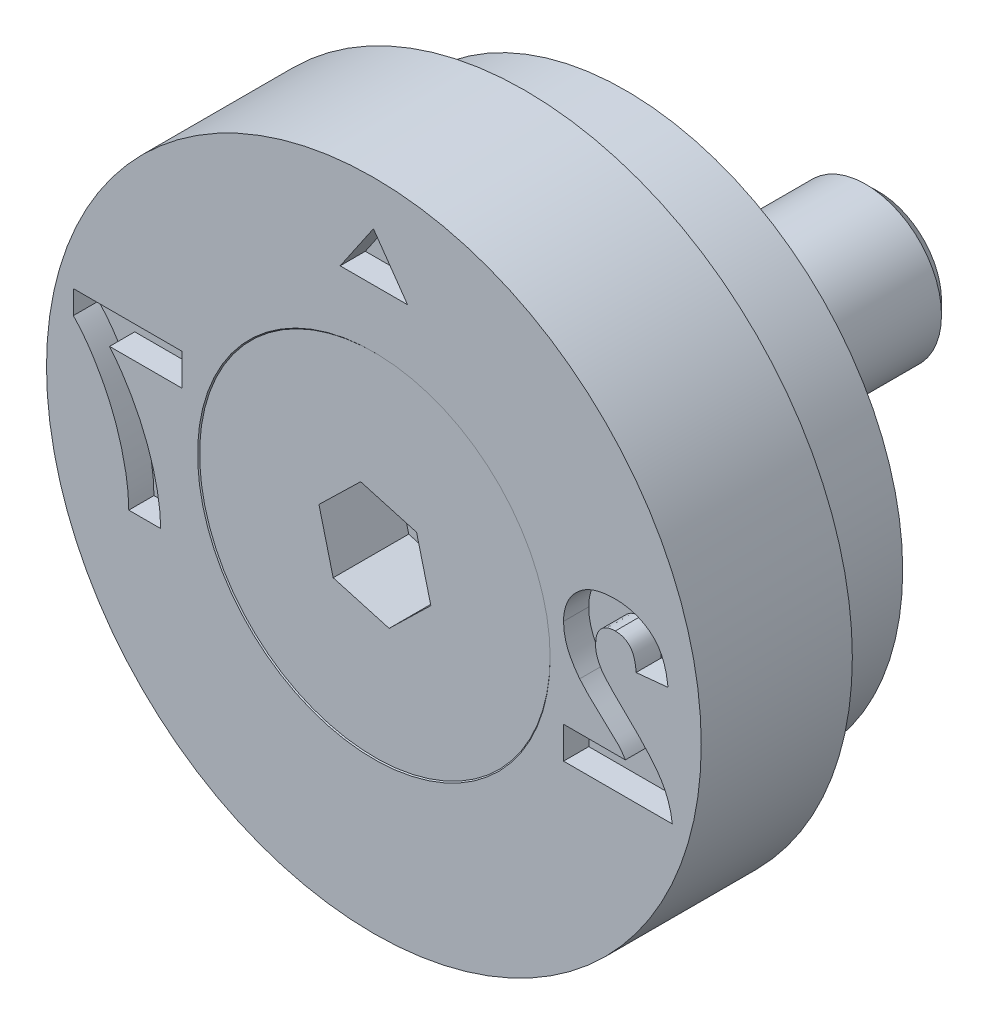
ISO-10303-21;
HEADER;
FILE_DESCRIPTION(('STEP AP214'),'2;1');
FILE_NAME('part.step','',(''),(''),'','','');
FILE_SCHEMA(('AUTOMOTIVE_DESIGN { 1 0 10303 214 1 1 1 1 }'));
ENDSEC;
DATA;
#1=APPLICATION_CONTEXT('core data for automotive mechanical design processes');
#2=APPLICATION_PROTOCOL_DEFINITION('international standard','automotive_design',2000,#1);
#3=PRODUCT_CONTEXT('',#1,'mechanical');
#4=PRODUCT('Part','Part','',(#3));
#5=PRODUCT_RELATED_PRODUCT_CATEGORY('part','',(#4));
#6=PRODUCT_DEFINITION_FORMATION('','',#4);
#7=PRODUCT_DEFINITION_CONTEXT('part definition',#1,'design');
#8=PRODUCT_DEFINITION('design','',#6,#7);
#9=PRODUCT_DEFINITION_SHAPE('','',#8);
#10=(LENGTH_UNIT() NAMED_UNIT(*) SI_UNIT(.MILLI.,.METRE.));
#11=(NAMED_UNIT(*) PLANE_ANGLE_UNIT() SI_UNIT($,.RADIAN.));
#12=(NAMED_UNIT(*) SI_UNIT($,.STERADIAN.) SOLID_ANGLE_UNIT());
#13=UNCERTAINTY_MEASURE_WITH_UNIT(LENGTH_MEASURE(1.E-05),#10,'distance_accuracy_value','');
#14=(GEOMETRIC_REPRESENTATION_CONTEXT(3) GLOBAL_UNCERTAINTY_ASSIGNED_CONTEXT((#13)) GLOBAL_UNIT_ASSIGNED_CONTEXT((#10,
#11,#12)) REPRESENTATION_CONTEXT('',''));
#15=CARTESIAN_POINT('',(0.,0.,0.));
#16=DIRECTION('',(0.,0.,1.));
#17=DIRECTION('',(1.,0.,0.));
#18=AXIS2_PLACEMENT_3D('',#15,#16,#17);
#19=CARTESIAN_POINT('',(0.,0.,-0.0200000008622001));
#20=DIRECTION('',(0.,0.,1.));
#21=DIRECTION('',(1.,0.,0.));
#22=AXIS2_PLACEMENT_3D('',#19,#20,#21);
#23=CYLINDRICAL_SURFACE('',#22,1.5);
#24=CARTESIAN_POINT('',(0.,0.,-2.0000000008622));
#25=DIRECTION('',(0.,0.,1.));
#26=DIRECTION('',(1.,0.,0.));
#27=AXIS2_PLACEMENT_3D('',#24,#25,#26);
#28=CIRCLE('',#27,1.5);
#29=CARTESIAN_POINT('',(1.5,0.,-2.0000000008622));
#30=VERTEX_POINT('',#29);
#31=EDGE_CURVE('E12',#30,#30,#28,.T.);
#32=ORIENTED_EDGE('',*,*,#31,.F.);
#33=EDGE_LOOP('',(#32));
#34=FACE_BOUND('',#33,.T.);
#35=CARTESIAN_POINT('',(0.,0.,-9.7700000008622));
#36=DIRECTION('',(0.,0.,1.));
#37=DIRECTION('',(1.,0.,0.));
#38=AXIS2_PLACEMENT_3D('',#35,#36,#37);
#39=CIRCLE('',#38,1.5);
#40=CARTESIAN_POINT('',(1.5,0.,-9.7700000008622));
#41=VERTEX_POINT('',#40);
#42=EDGE_CURVE('E150',#41,#41,#39,.T.);
#43=ORIENTED_EDGE('',*,*,#42,.T.);
#44=EDGE_LOOP('',(#43));
#45=FACE_BOUND('',#44,.T.);
#46=ADVANCED_FACE('F49',(#34,#45),#23,.T.);
#47=CARTESIAN_POINT('',(0.,0.,-2.0000000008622));
#48=DIRECTION('',(0.,0.,1.));
#49=DIRECTION('',(1.,0.,0.));
#50=AXIS2_PLACEMENT_3D('',#47,#48,#49);
#51=CONICAL_SURFACE('',#50,1.5,0.785398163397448);
#52=CARTESIAN_POINT('',(0.,0.,-0.0200000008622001));
#53=DIRECTION('',(0.,0.,1.));
#54=DIRECTION('',(1.,0.,0.));
#55=AXIS2_PLACEMENT_3D('',#52,#53,#54);
#56=CIRCLE('',#55,3.48);
#57=CARTESIAN_POINT('',(3.48,0.,-0.0200000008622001));
#58=VERTEX_POINT('',#57);
#59=EDGE_CURVE('E56',#58,#58,#56,.T.);
#60=ORIENTED_EDGE('',*,*,#59,.F.);
#61=EDGE_LOOP('',(#60));
#62=FACE_BOUND('',#61,.T.);
#63=ORIENTED_EDGE('',*,*,#31,.T.);
#64=EDGE_LOOP('',(#63));
#65=FACE_BOUND('',#64,.T.);
#66=ADVANCED_FACE('F165',(#62,#65),#51,.T.);
#67=CARTESIAN_POINT('',(0.,3.48,-0.0200000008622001));
#68=DIRECTION('',(0.,0.,-1.));
#69=DIRECTION('',(-1.,0.,0.));
#70=AXIS2_PLACEMENT_3D('',#67,#68,#69);
#71=PLANE('',#70);
#72=DIRECTION('',(0.962144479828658,-0.272539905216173,0.));
#73=VECTOR('',#72,1.);
#74=CARTESIAN_POINT('',(-0.828034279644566,-0.804793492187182,-0.0200000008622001));
#75=LINE('',#74,#73);
#76=CARTESIAN_POINT('',(-0.828034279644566,-0.804793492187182,-0.0200000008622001));
#77=VERTEX_POINT('',#76);
#78=CARTESIAN_POINT('',(0.282954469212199,-1.11949546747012,-0.0200000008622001));
#79=VERTEX_POINT('',#78);
#80=EDGE_CURVE('E137',#77,#79,#75,.T.);
#81=ORIENTED_EDGE('',*,*,#80,.F.);
#82=DIRECTION('',(0.245045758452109,-0.969511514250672,0.));
#83=VECTOR('',#82,1.);
#84=CARTESIAN_POINT('',(-1.11098874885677,0.314701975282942,-0.0200000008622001));
#85=LINE('',#84,#83);
#86=CARTESIAN_POINT('',(-1.11098874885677,0.314701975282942,-0.0200000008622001));
#87=VERTEX_POINT('',#86);
#88=EDGE_CURVE('E63',#87,#77,#85,.T.);
#89=ORIENTED_EDGE('',*,*,#88,.F.);
#90=DIRECTION('',(-0.717098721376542,-0.696971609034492,0.));
#91=VECTOR('',#90,1.);
#92=CARTESIAN_POINT('',(-0.282954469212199,1.11949546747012,-0.0200000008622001));
#93=LINE('',#92,#91);
#94=CARTESIAN_POINT('',(-0.282954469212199,1.11949546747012,-0.0200000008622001));
#95=VERTEX_POINT('',#94);
#96=EDGE_CURVE('E146',#95,#87,#93,.T.);
#97=ORIENTED_EDGE('',*,*,#96,.F.);
#98=DIRECTION('',(-0.962144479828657,0.272539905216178,0.));
#99=VECTOR('',#98,1.);
#100=CARTESIAN_POINT('',(0.828034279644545,0.804793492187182,-0.0200000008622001));
#101=LINE('',#100,#99);
#102=CARTESIAN_POINT('',(0.828034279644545,0.804793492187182,-0.0200000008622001));
#103=VERTEX_POINT('',#102);
#104=EDGE_CURVE('E144',#103,#95,#101,.T.);
#105=ORIENTED_EDGE('',*,*,#104,.F.);
#106=DIRECTION('',(-0.245045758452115,0.96951151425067,0.));
#107=VECTOR('',#106,1.);
#108=CARTESIAN_POINT('',(1.11098874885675,-0.314701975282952,-0.0200000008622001));
#109=LINE('',#108,#107);
#110=CARTESIAN_POINT('',(1.11098874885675,-0.314701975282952,-0.0200000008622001));
#111=VERTEX_POINT('',#110);
#112=EDGE_CURVE('E111',#111,#103,#109,.T.);
#113=ORIENTED_EDGE('',*,*,#112,.F.);
#114=DIRECTION('',(0.717098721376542,0.696971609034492,0.));
#115=VECTOR('',#114,1.);
#116=CARTESIAN_POINT('',(0.282954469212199,-1.11949546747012,-0.0200000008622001));
#117=LINE('',#116,#115);
#118=EDGE_CURVE('E140',#79,#111,#117,.T.);
#119=ORIENTED_EDGE('',*,*,#118,.F.);
#120=EDGE_LOOP('',(#81,#89,#97,#105,#113,#119));
#121=FACE_BOUND('',#120,.T.);
#122=ORIENTED_EDGE('',*,*,#59,.T.);
#123=EDGE_LOOP('',(#122));
#124=FACE_BOUND('',#123,.T.);
#125=ADVANCED_FACE('F163',(#121,#124),#71,.F.);
#126=CARTESIAN_POINT('',(0.,0.,-10.0200000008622));
#127=DIRECTION('',(0.,0.,1.));
#128=DIRECTION('',(1.,0.,0.));
#129=AXIS2_PLACEMENT_3D('',#126,#127,#128);
#130=PLANE('',#129);
#131=CARTESIAN_POINT('',(0.,0.,-10.0200000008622));
#132=DIRECTION('',(0.,0.,1.));
#133=DIRECTION('',(1.,0.,0.));
#134=AXIS2_PLACEMENT_3D('',#131,#132,#133);
#135=CIRCLE('',#134,1.25);
#136=CARTESIAN_POINT('',(1.25,0.,-10.0200000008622));
#137=VERTEX_POINT('',#136);
#138=EDGE_CURVE('E158',#137,#137,#135,.T.);
#139=ORIENTED_EDGE('',*,*,#138,.F.);
#140=EDGE_LOOP('',(#139));
#141=FACE_BOUND('',#140,.T.);
#142=ADVANCED_FACE('F178',(#141),#130,.F.);
#143=CARTESIAN_POINT('',(0.,0.,-10.0200000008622));
#144=DIRECTION('',(0.,0.,1.));
#145=DIRECTION('',(1.,0.,0.));
#146=AXIS2_PLACEMENT_3D('',#143,#144,#145);
#147=CONICAL_SURFACE('',#146,1.25,0.78539816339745);
#148=ORIENTED_EDGE('',*,*,#42,.F.);
#149=EDGE_LOOP('',(#148));
#150=FACE_BOUND('',#149,.T.);
#151=ORIENTED_EDGE('',*,*,#138,.T.);
#152=EDGE_LOOP('',(#151));
#153=FACE_BOUND('',#152,.T.);
#154=ADVANCED_FACE('F174',(#150,#153),#147,.T.);
#155=CARTESIAN_POINT('',(-1.11098874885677,0.314701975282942,-1.5200000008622));
#156=DIRECTION('',(-0.969511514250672,-0.245045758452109,0.));
#157=DIRECTION('',(0.245045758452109,-0.969511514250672,0.));
#158=AXIS2_PLACEMENT_3D('',#155,#156,#157);
#159=PLANE('',#158);
#160=ORIENTED_EDGE('',*,*,#88,.T.);
#161=DIRECTION('',(0.,0.,1.));
#162=VECTOR('',#161,1.);
#163=CARTESIAN_POINT('',(-0.828034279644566,-0.804793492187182,-1.5200000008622));
#164=LINE('',#163,#162);
#165=CARTESIAN_POINT('',(-0.828034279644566,-0.804793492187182,-1.5200000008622));
#166=VERTEX_POINT('',#165);
#167=EDGE_CURVE('E93',#166,#77,#164,.T.);
#168=ORIENTED_EDGE('',*,*,#167,.F.);
#169=DIRECTION('',(0.245045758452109,-0.969511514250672,0.));
#170=VECTOR('',#169,1.);
#171=CARTESIAN_POINT('',(-1.11098874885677,0.314701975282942,-1.5200000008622));
#172=LINE('',#171,#170);
#173=CARTESIAN_POINT('',(-1.11098874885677,0.314701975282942,-1.5200000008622));
#174=VERTEX_POINT('',#173);
#175=EDGE_CURVE('E148',#174,#166,#172,.T.);
#176=ORIENTED_EDGE('',*,*,#175,.F.);
#177=DIRECTION('',(0.,0.,1.));
#178=VECTOR('',#177,1.);
#179=CARTESIAN_POINT('',(-1.11098874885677,0.314701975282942,-1.5200000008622));
#180=LINE('',#179,#178);
#181=EDGE_CURVE('E71',#174,#87,#180,.T.);
#182=ORIENTED_EDGE('',*,*,#181,.T.);
#183=EDGE_LOOP('',(#160,#168,#176,#182));
#184=FACE_BOUND('',#183,.T.);
#185=ADVANCED_FACE('F177',(#184),#159,.F.);
#186=CARTESIAN_POINT('',(-0.282954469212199,1.11949546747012,-1.5200000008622));
#187=DIRECTION('',(-0.696971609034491,0.717098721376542,0.));
#188=DIRECTION('',(-0.717098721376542,-0.696971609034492,0.));
#189=AXIS2_PLACEMENT_3D('',#186,#187,#188);
#190=PLANE('',#189);
#191=ORIENTED_EDGE('',*,*,#96,.T.);
#192=ORIENTED_EDGE('',*,*,#181,.F.);
#193=DIRECTION('',(-0.717098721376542,-0.696971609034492,0.));
#194=VECTOR('',#193,1.);
#195=CARTESIAN_POINT('',(-0.282954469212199,1.11949546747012,-1.5200000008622));
#196=LINE('',#195,#194);
#197=CARTESIAN_POINT('',(-0.282954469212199,1.11949546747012,-1.5200000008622));
#198=VERTEX_POINT('',#197);
#199=EDGE_CURVE('E123',#198,#174,#196,.T.);
#200=ORIENTED_EDGE('',*,*,#199,.F.);
#201=DIRECTION('',(0.,0.,1.));
#202=VECTOR('',#201,1.);
#203=CARTESIAN_POINT('',(-0.282954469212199,1.11949546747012,-1.5200000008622));
#204=LINE('',#203,#202);
#205=EDGE_CURVE('E115',#198,#95,#204,.T.);
#206=ORIENTED_EDGE('',*,*,#205,.T.);
#207=EDGE_LOOP('',(#191,#192,#200,#206));
#208=FACE_BOUND('',#207,.T.);
#209=ADVANCED_FACE('F192',(#208),#190,.F.);
#210=CARTESIAN_POINT('',(0.828034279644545,0.804793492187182,-1.5200000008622));
#211=DIRECTION('',(0.272539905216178,0.962144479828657,0.));
#212=DIRECTION('',(-0.962144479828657,0.272539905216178,0.));
#213=AXIS2_PLACEMENT_3D('',#210,#211,#212);
#214=PLANE('',#213);
#215=ORIENTED_EDGE('',*,*,#104,.T.);
#216=ORIENTED_EDGE('',*,*,#205,.F.);
#217=DIRECTION('',(-0.962144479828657,0.272539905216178,0.));
#218=VECTOR('',#217,1.);
#219=CARTESIAN_POINT('',(0.828034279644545,0.804793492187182,-1.5200000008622));
#220=LINE('',#219,#218);
#221=CARTESIAN_POINT('',(0.828034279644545,0.804793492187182,-1.5200000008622));
#222=VERTEX_POINT('',#221);
#223=EDGE_CURVE('E119',#222,#198,#220,.T.);
#224=ORIENTED_EDGE('',*,*,#223,.F.);
#225=DIRECTION('',(0.,0.,1.));
#226=VECTOR('',#225,1.);
#227=CARTESIAN_POINT('',(0.828034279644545,0.804793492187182,-1.5200000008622));
#228=LINE('',#227,#226);
#229=EDGE_CURVE('E104',#222,#103,#228,.T.);
#230=ORIENTED_EDGE('',*,*,#229,.T.);
#231=EDGE_LOOP('',(#215,#216,#224,#230));
#232=FACE_BOUND('',#231,.T.);
#233=ADVANCED_FACE('F120',(#232),#214,.F.);
#234=CARTESIAN_POINT('',(1.11098874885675,-0.314701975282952,-1.5200000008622));
#235=DIRECTION('',(0.96951151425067,0.245045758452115,0.));
#236=DIRECTION('',(-0.245045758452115,0.96951151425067,0.));
#237=AXIS2_PLACEMENT_3D('',#234,#235,#236);
#238=PLANE('',#237);
#239=ORIENTED_EDGE('',*,*,#112,.T.);
#240=ORIENTED_EDGE('',*,*,#229,.F.);
#241=DIRECTION('',(-0.245045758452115,0.96951151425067,0.));
#242=VECTOR('',#241,1.);
#243=CARTESIAN_POINT('',(1.11098874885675,-0.314701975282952,-1.5200000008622));
#244=LINE('',#243,#242);
#245=CARTESIAN_POINT('',(1.11098874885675,-0.314701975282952,-1.5200000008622));
#246=VERTEX_POINT('',#245);
#247=EDGE_CURVE('E108',#246,#222,#244,.T.);
#248=ORIENTED_EDGE('',*,*,#247,.F.);
#249=DIRECTION('',(0.,0.,1.));
#250=VECTOR('',#249,1.);
#251=CARTESIAN_POINT('',(1.11098874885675,-0.314701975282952,-1.5200000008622));
#252=LINE('',#251,#250);
#253=EDGE_CURVE('E116',#246,#111,#252,.T.);
#254=ORIENTED_EDGE('',*,*,#253,.T.);
#255=EDGE_LOOP('',(#239,#240,#248,#254));
#256=FACE_BOUND('',#255,.T.);
#257=ADVANCED_FACE('F106',(#256),#238,.F.);
#258=CARTESIAN_POINT('',(0.282954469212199,-1.11949546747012,-1.5200000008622));
#259=DIRECTION('',(0.696971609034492,-0.717098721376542,0.));
#260=DIRECTION('',(0.717098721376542,0.696971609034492,0.));
#261=AXIS2_PLACEMENT_3D('',#258,#259,#260);
#262=PLANE('',#261);
#263=ORIENTED_EDGE('',*,*,#118,.T.);
#264=ORIENTED_EDGE('',*,*,#253,.F.);
#265=DIRECTION('',(0.717098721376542,0.696971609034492,0.));
#266=VECTOR('',#265,1.);
#267=CARTESIAN_POINT('',(0.282954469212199,-1.11949546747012,-1.5200000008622));
#268=LINE('',#267,#266);
#269=CARTESIAN_POINT('',(0.282954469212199,-1.11949546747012,-1.5200000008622));
#270=VERTEX_POINT('',#269);
#271=EDGE_CURVE('E129',#270,#246,#268,.T.);
#272=ORIENTED_EDGE('',*,*,#271,.F.);
#273=DIRECTION('',(0.,0.,1.));
#274=VECTOR('',#273,1.);
#275=CARTESIAN_POINT('',(0.282954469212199,-1.11949546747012,-1.5200000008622));
#276=LINE('',#275,#274);
#277=EDGE_CURVE('E153',#270,#79,#276,.T.);
#278=ORIENTED_EDGE('',*,*,#277,.T.);
#279=EDGE_LOOP('',(#263,#264,#272,#278));
#280=FACE_BOUND('',#279,.T.);
#281=ADVANCED_FACE('F196',(#280),#262,.F.);
#282=CARTESIAN_POINT('',(-0.828034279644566,-0.804793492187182,-1.5200000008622));
#283=DIRECTION('',(-0.272539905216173,-0.962144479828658,0.));
#284=DIRECTION('',(0.962144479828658,-0.272539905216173,0.));
#285=AXIS2_PLACEMENT_3D('',#282,#283,#284);
#286=PLANE('',#285);
#287=ORIENTED_EDGE('',*,*,#80,.T.);
#288=ORIENTED_EDGE('',*,*,#277,.F.);
#289=DIRECTION('',(0.962144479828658,-0.272539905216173,0.));
#290=VECTOR('',#289,1.);
#291=CARTESIAN_POINT('',(-0.828034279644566,-0.804793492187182,-1.5200000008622));
#292=LINE('',#291,#290);
#293=EDGE_CURVE('E131',#166,#270,#292,.T.);
#294=ORIENTED_EDGE('',*,*,#293,.F.);
#295=ORIENTED_EDGE('',*,*,#167,.T.);
#296=EDGE_LOOP('',(#287,#288,#294,#295));
#297=FACE_BOUND('',#296,.T.);
#298=ADVANCED_FACE('F193',(#297),#286,.F.);
#299=CARTESIAN_POINT('',(0.,0.,-1.5200000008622));
#300=DIRECTION('',(0.,0.,1.));
#301=DIRECTION('',(1.,0.,0.));
#302=AXIS2_PLACEMENT_3D('',#299,#300,#301);
#303=PLANE('',#302);
#304=ORIENTED_EDGE('',*,*,#175,.T.);
#305=ORIENTED_EDGE('',*,*,#293,.T.);
#306=ORIENTED_EDGE('',*,*,#271,.T.);
#307=ORIENTED_EDGE('',*,*,#247,.T.);
#308=ORIENTED_EDGE('',*,*,#223,.T.);
#309=ORIENTED_EDGE('',*,*,#199,.T.);
#310=EDGE_LOOP('',(#304,#305,#306,#307,#308,#309));
#311=FACE_BOUND('',#310,.T.);
#312=ADVANCED_FACE('F126',(#311),#303,.T.);
#313=CLOSED_SHELL('',(#46,#66,#125,#142,#154,#185,#209,#233,#257,#281,#298,#312));
#314=MANIFOLD_SOLID_BREP('B2',#313);
#315=CARTESIAN_POINT('',(0.,0.,3.12219627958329));
#316=DIRECTION('',(0.,0.,1.));
#317=DIRECTION('',(1.,0.,0.));
#318=AXIS2_PLACEMENT_3D('',#315,#316,#317);
#319=CYLINDRICAL_SURFACE('',#318,6.5);
#320=CARTESIAN_POINT('',(0.,0.,0.));
#321=DIRECTION('',(0.,0.,1.));
#322=DIRECTION('',(1.,0.,0.));
#323=AXIS2_PLACEMENT_3D('',#320,#321,#322);
#324=CIRCLE('',#323,6.5);
#325=CARTESIAN_POINT('',(6.5,0.,0.));
#326=VERTEX_POINT('',#325);
#327=EDGE_CURVE('E47',#326,#326,#324,.T.);
#328=ORIENTED_EDGE('',*,*,#327,.F.);
#329=EDGE_LOOP('',(#328));
#330=FACE_BOUND('',#329,.T.);
#331=CARTESIAN_POINT('',(0.,0.,-3.));
#332=DIRECTION('',(0.,0.,1.));
#333=DIRECTION('',(1.,0.,0.));
#334=AXIS2_PLACEMENT_3D('',#331,#332,#333);
#335=CIRCLE('',#334,6.5);
#336=CARTESIAN_POINT('',(6.5,0.,-3.));
#337=VERTEX_POINT('',#336);
#338=EDGE_CURVE('E611',#337,#337,#335,.T.);
#339=ORIENTED_EDGE('',*,*,#338,.T.);
#340=EDGE_LOOP('',(#339));
#341=FACE_BOUND('',#340,.T.);
#342=ADVANCED_FACE('F308',(#330,#341),#319,.T.);
#343=CARTESIAN_POINT('',(0.,6.5,0.));
#344=DIRECTION('',(0.,0.,-1.));
#345=DIRECTION('',(-1.,0.,0.));
#346=AXIS2_PLACEMENT_3D('',#343,#344,#345);
#347=PLANE('',#346);
#348=DIRECTION('',(0.,-1.,0.));
#349=VECTOR('',#348,1.);
#350=CARTESIAN_POINT('',(3.76627823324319,-1.016,0.));
#351=LINE('',#350,#349);
#352=CARTESIAN_POINT('',(3.76627823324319,-1.016,0.));
#353=VERTEX_POINT('',#352);
#354=CARTESIAN_POINT('',(3.76627823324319,-1.651,0.));
#355=VERTEX_POINT('',#354);
#356=EDGE_CURVE('E820',#353,#355,#351,.T.);
#357=ORIENTED_EDGE('',*,*,#356,.F.);
#358=DIRECTION('',(-1.,0.,0.));
#359=VECTOR('',#358,1.);
#360=CARTESIAN_POINT('',(4.99328344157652,-1.016,0.));
#361=LINE('',#360,#359);
#362=CARTESIAN_POINT('',(4.99328344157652,-1.016,0.));
#363=VERTEX_POINT('',#362);
#364=EDGE_CURVE('E322',#363,#353,#361,.T.);
#365=ORIENTED_EDGE('',*,*,#364,.F.);
#366=CARTESIAN_POINT('',(4.08642406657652,-0.07540625,0.));
#367=CARTESIAN_POINT('',(4.09646740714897,-0.0880558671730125,0.));
#368=CARTESIAN_POINT('',(4.11797791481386,-0.115148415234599,0.));
#369=CARTESIAN_POINT('',(4.15457294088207,-0.156690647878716,0.));
#370=CARTESIAN_POINT('',(4.19698342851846,-0.202067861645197,0.));
#371=CARTESIAN_POINT('',(4.24461034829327,-0.252129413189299,0.));
#372=CARTESIAN_POINT('',(4.29902691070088,-0.305102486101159,0.));
#373=CARTESIAN_POINT('',(4.35827520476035,-0.363202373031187,0.));
#374=CARTESIAN_POINT('',(4.42496232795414,-0.423457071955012,0.));
#375=CARTESIAN_POINT('',(4.4940340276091,-0.487369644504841,0.));
#376=CARTESIAN_POINT('',(4.56340596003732,-0.549574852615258,0.));
#377=CARTESIAN_POINT('',(4.62716876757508,-0.608656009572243,0.));
#378=CARTESIAN_POINT('',(4.68508661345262,-0.660930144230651,0.));
#379=CARTESIAN_POINT('',(4.73446215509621,-0.709283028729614,0.));
#380=CARTESIAN_POINT('',(4.77819964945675,-0.750414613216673,0.));
#381=CARTESIAN_POINT('',(4.81472265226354,-0.786434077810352,0.));
#382=CARTESIAN_POINT('',(4.84471459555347,-0.816469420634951,0.));
#383=CARTESIAN_POINT('',(4.88604156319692,-0.863286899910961,0.));
#384=CARTESIAN_POINT('',(4.93862543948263,-0.926607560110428,0.));
#385=CARTESIAN_POINT('',(4.97562034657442,-0.987112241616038,0.));
#386=CARTESIAN_POINT('',(4.99328344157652,-1.016,0.));
#387=B_SPLINE_CURVE_WITH_KNOTS('',3,(#366,#367,#368,#369,#370,#371,#372,#373,#374,#375,#376,
#377,#378,#379,#380,#381,#382,#383,#384,#385,#386),.UNSPECIFIED.,.F.,.F.,(4,1,1,1,1,1,1,1,1,1,1,
1,1,1,1,1,1,1,4),(0.,0.0369753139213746,0.0791925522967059,0.126700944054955,0.179184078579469,
0.23736864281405,0.300558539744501,0.369153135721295,0.443112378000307,0.516018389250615,
0.582473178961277,0.642136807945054,0.694619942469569,0.740679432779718,0.779589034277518,
0.812073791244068,0.837814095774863,0.922564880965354,1.),.UNSPECIFIED.);
#388=CARTESIAN_POINT('',(4.08642406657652,-0.07540625,0.));
#389=VERTEX_POINT('',#388);
#390=EDGE_CURVE('E483',#389,#363,#387,.T.);
#391=ORIENTED_EDGE('',*,*,#390,.F.);
#392=CARTESIAN_POINT('',(3.76627823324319,0.752739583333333,0.));
#393=CARTESIAN_POINT('',(3.76708610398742,0.716746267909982,0.));
#394=CARTESIAN_POINT('',(3.76868879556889,0.64534105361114,0.));
#395=CARTESIAN_POINT('',(3.78403337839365,0.539782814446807,0.));
#396=CARTESIAN_POINT('',(3.80747691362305,0.436658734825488,0.));
#397=CARTESIAN_POINT('',(3.84212461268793,0.33571678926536,0.));
#398=CARTESIAN_POINT('',(3.88604326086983,0.234535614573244,0.));
#399=CARTESIAN_POINT('',(3.94265545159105,0.13288810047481,0.));
#400=CARTESIAN_POINT('',(4.00838648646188,0.027708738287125,0.));
#401=CARTESIAN_POINT('',(4.05985129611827,-0.0402943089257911,0.));
#402=CARTESIAN_POINT('',(4.08642406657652,-0.07540625,0.));
#403=B_SPLINE_CURVE_WITH_KNOTS('',3,(#392,#393,#394,#395,#396,#397,#398,#399,#400,#401,#402),
.UNSPECIFIED.,.F.,.F.,(4,1,1,1,1,1,1,1,4),(0.,0.119176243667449,0.236427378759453,
0.352663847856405,0.469086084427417,0.589462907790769,0.717601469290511,0.854189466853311,1.),.UNSPECIFIED.);
#404=CARTESIAN_POINT('',(3.76627823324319,0.752739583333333,0.));
#405=VERTEX_POINT('',#404);
#406=EDGE_CURVE('E486',#405,#389,#403,.T.);
#407=ORIENTED_EDGE('',*,*,#406,.F.);
#408=CARTESIAN_POINT('',(4.77963239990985,1.651,0.));
#409=CARTESIAN_POINT('',(4.74123941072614,1.65026210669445,0.));
#410=CARTESIAN_POINT('',(4.66646424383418,1.64882496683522,0.));
#411=CARTESIAN_POINT('',(4.55730577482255,1.63695705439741,0.));
#412=CARTESIAN_POINT('',(4.45475923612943,1.61626362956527,0.));
#413=CARTESIAN_POINT('',(4.35792809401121,1.58885225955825,0.));
#414=CARTESIAN_POINT('',(4.26780675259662,1.55225607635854,0.));
#415=CARTESIAN_POINT('',(4.18364423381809,1.50801281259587,0.));
#416=CARTESIAN_POINT('',(4.10676510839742,1.45444334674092,0.));
#417=CARTESIAN_POINT('',(4.03602338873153,1.39446904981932,0.));
#418=CARTESIAN_POINT('',(3.97278595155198,1.32851676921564,0.));
#419=CARTESIAN_POINT('',(3.91739567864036,1.25816751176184,0.));
#420=CARTESIAN_POINT('',(3.87098989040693,1.18347028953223,0.));
#421=CARTESIAN_POINT('',(3.83204830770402,1.10533557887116,0.));
#422=CARTESIAN_POINT('',(3.80313444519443,1.02250607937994,0.));
#423=CARTESIAN_POINT('',(3.78206654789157,0.936127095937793,0.));
#424=CARTESIAN_POINT('',(3.76809768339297,0.845795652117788,0.));
#425=CARTESIAN_POINT('',(3.76689142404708,0.784101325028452,0.));
#426=CARTESIAN_POINT('',(3.76627823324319,0.752739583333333,0.));
#427=B_SPLINE_CURVE_WITH_KNOTS('',3,(#408,#409,#410,#411,#412,#413,#414,#415,#416,#417,#418,
#419,#420,#421,#422,#423,#424,#425,#426),.UNSPECIFIED.,.F.,.F.,(4,1,1,1,1,1,1,1,1,1,1,1,1,1,1,1,
4),(0.,0.0756723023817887,0.147381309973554,0.216084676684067,0.281698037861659,
0.345459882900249,0.407485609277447,0.46873129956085,0.529782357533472,0.590032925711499,
0.648548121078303,0.70595351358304,0.763101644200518,0.820289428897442,0.878479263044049,
0.938226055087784,1.),.UNSPECIFIED.);
#428=CARTESIAN_POINT('',(4.77963239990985,1.651,0.));
#429=VERTEX_POINT('',#428);
#430=EDGE_CURVE('E755',#429,#405,#427,.T.);
#431=ORIENTED_EDGE('',*,*,#430,.F.);
#432=CARTESIAN_POINT('',(5.84061156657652,0.65484375,0.));
#433=CARTESIAN_POINT('',(5.83550626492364,0.697714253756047,0.));
#434=CARTESIAN_POINT('',(5.82560790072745,0.780833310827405,0.));
#435=CARTESIAN_POINT('',(5.80090636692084,0.900220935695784,0.));
#436=CARTESIAN_POINT('',(5.76962278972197,1.01036140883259,0.));
#437=CARTESIAN_POINT('',(5.73026577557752,1.11105032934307,0.));
#438=CARTESIAN_POINT('',(5.68446199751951,1.20292798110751,0.));
#439=CARTESIAN_POINT('',(5.6298750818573,1.28461568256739,0.));
#440=CARTESIAN_POINT('',(5.56841235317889,1.35701830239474,0.));
#441=CARTESIAN_POINT('',(5.50002069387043,1.42009730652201,0.));
#442=CARTESIAN_POINT('',(5.42513489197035,1.47405336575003,0.));
#443=CARTESIAN_POINT('',(5.34655567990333,1.52221742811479,0.));
#444=CARTESIAN_POINT('',(5.26274740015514,1.56172727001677,0.));
#445=CARTESIAN_POINT('',(5.17463278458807,1.59428931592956,0.));
#446=CARTESIAN_POINT('',(5.08225165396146,1.6203126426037,0.));
#447=CARTESIAN_POINT('',(4.98517673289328,1.63751891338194,0.));
#448=CARTESIAN_POINT('',(4.88400713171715,1.64962187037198,0.));
#449=CARTESIAN_POINT('',(4.81494833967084,1.65053369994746,0.));
#450=CARTESIAN_POINT('',(4.77963239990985,1.651,0.));
#451=B_SPLINE_CURVE_WITH_KNOTS('',3,(#432,#433,#434,#435,#436,#437,#438,#439,#440,#441,#442,
#443,#444,#445,#446,#447,#448,#449,#450),.UNSPECIFIED.,.F.,.F.,(4,1,1,1,1,1,1,1,1,1,1,1,1,1,1,1,
4),(0.,0.0794357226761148,0.154013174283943,0.224141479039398,0.289934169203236,
0.352732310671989,0.412725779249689,0.470302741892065,0.527168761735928,0.583502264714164,
0.639948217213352,0.696584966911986,0.753726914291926,0.812707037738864,0.872963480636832,
0.93503486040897,1.),.UNSPECIFIED.);
#452=CARTESIAN_POINT('',(5.84061156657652,0.65484375,0.));
#453=VERTEX_POINT('',#452);
#454=EDGE_CURVE('E763',#453,#429,#451,.T.);
#455=ORIENTED_EDGE('',*,*,#454,.F.);
#456=DIRECTION('',(0.995240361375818,0.0974506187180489,0.));
#457=VECTOR('',#456,1.);
#458=CARTESIAN_POINT('',(5.20561156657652,0.592666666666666,0.));
#459=LINE('',#458,#457);
#460=CARTESIAN_POINT('',(5.20561156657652,0.592666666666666,0.));
#461=VERTEX_POINT('',#460);
#462=EDGE_CURVE('E771',#461,#453,#459,.T.);
#463=ORIENTED_EDGE('',*,*,#462,.F.);
#464=CARTESIAN_POINT('',(4.79286156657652,1.10066666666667,0.));
#465=CARTESIAN_POINT('',(4.82166239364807,1.09936181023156,0.));
#466=CARTESIAN_POINT('',(4.8772993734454,1.09684110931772,0.));
#467=CARTESIAN_POINT('',(4.95637159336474,1.07482061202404,0.));
#468=CARTESIAN_POINT('',(5.02554519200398,1.0367008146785,0.));
#469=CARTESIAN_POINT('',(5.07484197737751,0.993259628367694,0.));
#470=CARTESIAN_POINT('',(5.10814429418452,0.951016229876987,0.));
#471=CARTESIAN_POINT('',(5.1308353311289,0.914203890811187,0.));
#472=CARTESIAN_POINT('',(5.15039323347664,0.872373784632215,0.));
#473=CARTESIAN_POINT('',(5.16772316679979,0.8259968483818,0.));
#474=CARTESIAN_POINT('',(5.18141185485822,0.774541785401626,0.));
#475=CARTESIAN_POINT('',(5.19243587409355,0.718400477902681,0.));
#476=CARTESIAN_POINT('',(5.20131963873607,0.657270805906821,0.));
#477=CARTESIAN_POINT('',(5.20414483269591,0.614744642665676,0.));
#478=CARTESIAN_POINT('',(5.20561156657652,0.592666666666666,0.));
#479=B_SPLINE_CURVE_WITH_KNOTS('',3,(#464,#465,#466,#467,#468,#469,#470,#471,#472,#473,#474,
#475,#476,#477,#478),.UNSPECIFIED.,.F.,.F.,(4,1,1,1,1,1,1,1,1,1,1,1,4),(0.,0.116899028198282,
0.225823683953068,0.330086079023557,0.43545148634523,0.490306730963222,0.548244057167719,
0.610766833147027,0.677675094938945,0.749188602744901,0.826858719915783,0.910111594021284,1.),.UNSPECIFIED.);
#480=CARTESIAN_POINT('',(4.79286156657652,1.10066666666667,0.));
#481=VERTEX_POINT('',#480);
#482=EDGE_CURVE('E777',#481,#461,#479,.T.);
#483=ORIENTED_EDGE('',*,*,#482,.F.);
#484=CARTESIAN_POINT('',(4.40127823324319,0.667411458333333,0.));
#485=CARTESIAN_POINT('',(4.40246750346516,0.700356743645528,0.));
#486=CARTESIAN_POINT('',(4.4047175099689,0.762686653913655,0.));
#487=CARTESIAN_POINT('',(4.42358420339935,0.850645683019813,0.));
#488=CARTESIAN_POINT('',(4.45704122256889,0.926258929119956,0.));
#489=CARTESIAN_POINT('',(4.5031053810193,0.989758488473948,0.));
#490=CARTESIAN_POINT('',(4.56135360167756,1.03951015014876,0.));
#491=CARTESIAN_POINT('',(4.62944746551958,1.07627179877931,0.));
#492=CARTESIAN_POINT('',(4.70838375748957,1.09659619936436,0.));
#493=CARTESIAN_POINT('',(4.76386484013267,1.09926949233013,0.));
#494=CARTESIAN_POINT('',(4.79286156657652,1.10066666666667,0.));
#495=B_SPLINE_CURVE_WITH_KNOTS('',3,(#484,#485,#486,#487,#488,#489,#490,#491,#492,#493,#494),
.UNSPECIFIED.,.F.,.F.,(4,1,1,1,1,1,1,1,4),(0.,0.149140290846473,0.282161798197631,
0.40465570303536,0.521109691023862,0.63441645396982,0.748796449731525,0.868710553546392,1.),.UNSPECIFIED.);
#496=CARTESIAN_POINT('',(4.40127823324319,0.667411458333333,0.));
#497=VERTEX_POINT('',#496);
#498=EDGE_CURVE('E782',#497,#481,#495,.T.);
#499=ORIENTED_EDGE('',*,*,#498,.F.);
#500=CARTESIAN_POINT('',(4.52695531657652,0.28575,0.));
#501=CARTESIAN_POINT('',(4.50783689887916,0.317507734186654,0.));
#502=CARTESIAN_POINT('',(4.47095968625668,0.378764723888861,0.));
#503=CARTESIAN_POINT('',(4.43052076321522,0.475092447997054,0.));
#504=CARTESIAN_POINT('',(4.40624781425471,0.571400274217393,0.));
#505=CARTESIAN_POINT('',(4.40291690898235,0.635752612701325,0.));
#506=CARTESIAN_POINT('',(4.40127823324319,0.667411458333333,0.));
#507=B_SPLINE_CURVE_WITH_KNOTS('',3,(#500,#501,#502,#503,#504,#505,#506),.UNSPECIFIED.,.F.,.F.,
(4,1,1,1,4),(0.,0.272795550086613,0.526191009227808,0.766904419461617,1.),.UNSPECIFIED.);
#508=CARTESIAN_POINT('',(4.52695531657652,0.28575,0.));
#509=VERTEX_POINT('',#508);
#510=EDGE_CURVE('E790',#509,#497,#507,.T.);
#511=ORIENTED_EDGE('',*,*,#510,.F.);
#512=CARTESIAN_POINT('',(5.03230948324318,-0.247385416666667,0.));
#513=CARTESIAN_POINT('',(4.99966251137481,-0.215872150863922,0.));
#514=CARTESIAN_POINT('',(4.93751229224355,-0.155880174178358,0.));
#515=CARTESIAN_POINT('',(4.84901025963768,-0.0699740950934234,0.));
#516=CARTESIAN_POINT('',(4.77120785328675,0.00899800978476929,0.));
#517=CARTESIAN_POINT('',(4.70247833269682,0.0789896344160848,0.));
#518=CARTESIAN_POINT('',(4.64440944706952,0.141782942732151,0.));
#519=CARTESIAN_POINT('',(4.59623735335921,0.196391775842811,0.));
#520=CARTESIAN_POINT('',(4.55735195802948,0.243038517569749,0.));
#521=CARTESIAN_POINT('',(4.53629159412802,0.272631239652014,0.));
#522=CARTESIAN_POINT('',(4.52695531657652,0.28575,0.));
#523=B_SPLINE_CURVE_WITH_KNOTS('',3,(#512,#513,#514,#515,#516,#517,#518,#519,#520,#521,#522),
.UNSPECIFIED.,.F.,.F.,(4,1,1,1,1,1,1,1,4),(0.,0.18509006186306,0.352356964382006,
0.503079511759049,0.637279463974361,0.752473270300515,0.851885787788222,0.934339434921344,1.),.UNSPECIFIED.);
#524=CARTESIAN_POINT('',(5.03230948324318,-0.247385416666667,0.));
#525=VERTEX_POINT('',#524);
#526=EDGE_CURVE('E798',#525,#509,#523,.T.);
#527=ORIENTED_EDGE('',*,*,#526,.F.);
#528=CARTESIAN_POINT('',(5.92527823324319,-1.651,0.));
#529=CARTESIAN_POINT('',(5.91796835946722,-1.59673003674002,0.));
#530=CARTESIAN_POINT('',(5.90335271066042,-1.48822054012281,0.));
#531=CARTESIAN_POINT('',(5.85816634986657,-1.32971547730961,0.));
#532=CARTESIAN_POINT('',(5.79785803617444,-1.17504161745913,0.));
#533=CARTESIAN_POINT('',(5.73240481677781,-1.04917463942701,0.));
#534=CARTESIAN_POINT('',(5.66730434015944,-0.947856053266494,0.));
#535=CARTESIAN_POINT('',(5.60823867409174,-0.864834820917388,0.));
#536=CARTESIAN_POINT('',(5.53777550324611,-0.776503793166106,0.));
#537=CARTESIAN_POINT('',(5.45693732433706,-0.682149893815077,0.));
#538=CARTESIAN_POINT('',(5.3661708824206,-0.58147817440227,0.));
#539=CARTESIAN_POINT('',(5.26479900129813,-0.474862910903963,0.));
#540=CARTESIAN_POINT('',(5.15233812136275,-0.362814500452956,0.));
#541=CARTESIAN_POINT('',(5.07321988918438,-0.286728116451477,0.));
#542=CARTESIAN_POINT('',(5.03230948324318,-0.247385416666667,0.));
#543=B_SPLINE_CURVE_WITH_KNOTS('',3,(#528,#529,#530,#531,#532,#533,#534,#535,#536,#537,#538,
#539,#540,#541,#542),.UNSPECIFIED.,.F.,.F.,(4,1,1,1,1,1,1,1,1,1,1,1,4),(0.,0.0963574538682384,
0.192660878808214,0.289454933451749,0.388479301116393,0.441921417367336,0.501521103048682,
0.567882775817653,0.640891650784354,0.72037065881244,0.806636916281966,0.900015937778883,1.),.UNSPECIFIED.);
#544=CARTESIAN_POINT('',(5.92527823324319,-1.651,0.));
#545=VERTEX_POINT('',#544);
#546=EDGE_CURVE('E806',#545,#525,#543,.T.);
#547=ORIENTED_EDGE('',*,*,#546,.F.);
#548=DIRECTION('',(1.,0.,0.));
#549=VECTOR('',#548,1.);
#550=CARTESIAN_POINT('',(3.76627823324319,-1.651,0.));
#551=LINE('',#550,#549);
#552=EDGE_CURVE('E814',#355,#545,#551,.T.);
#553=ORIENTED_EDGE('',*,*,#552,.F.);
#554=EDGE_LOOP('',(#357,#365,#391,#407,#431,#455,#463,#483,#499,#511,#527,#547,#553));
#555=FACE_BOUND('',#554,.T.);
#556=DIRECTION('',(0.,1.,0.));
#557=VECTOR('',#556,1.);
#558=CARTESIAN_POINT('',(-3.80800176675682,0.973666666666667,0.));
#559=LINE('',#558,#557);
#560=CARTESIAN_POINT('',(-3.80800176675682,0.973666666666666,0.));
#561=VERTEX_POINT('',#560);
#562=CARTESIAN_POINT('',(-3.80800176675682,1.60866666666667,0.));
#563=VERTEX_POINT('',#562);
#564=EDGE_CURVE('E548',#561,#563,#559,.T.);
#565=ORIENTED_EDGE('',*,*,#564,.F.);
#566=DIRECTION('',(1.,0.,0.));
#567=VECTOR('',#566,1.);
#568=CARTESIAN_POINT('',(-5.24799655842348,0.973666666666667,0.));
#569=LINE('',#568,#567);
#570=CARTESIAN_POINT('',(-5.24799655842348,0.973666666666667,0.));
#571=VERTEX_POINT('',#570);
#572=EDGE_CURVE('E330',#571,#561,#569,.T.);
#573=ORIENTED_EDGE('',*,*,#572,.F.);
#574=CARTESIAN_POINT('',(-4.23133510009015,-1.651,0.));
#575=CARTESIAN_POINT('',(-4.23345839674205,-1.59474645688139,0.));
#576=CARTESIAN_POINT('',(-4.23772857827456,-1.4816144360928,0.));
#577=CARTESIAN_POINT('',(-4.25370524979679,-1.31180696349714,0.));
#578=CARTESIAN_POINT('',(-4.27879833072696,-1.14136720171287,0.));
#579=CARTESIAN_POINT('',(-4.3099656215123,-0.969901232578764,0.));
#580=CARTESIAN_POINT('',(-4.35111421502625,-0.797826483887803,0.));
#581=CARTESIAN_POINT('',(-4.39807736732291,-0.624505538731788,0.));
#582=CARTESIAN_POINT('',(-4.45496616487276,-0.450864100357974,0.));
#583=CARTESIAN_POINT('',(-4.51873698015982,-0.277234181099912,0.));
#584=CARTESIAN_POINT('',(-4.5891366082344,-0.105264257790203,0.));
#585=CARTESIAN_POINT('',(-4.66586229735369,0.0629126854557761,0.));
#586=CARTESIAN_POINT('',(-4.74871570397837,0.226247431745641,0.));
#587=CARTESIAN_POINT('',(-4.83661933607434,0.38531385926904,0.));
#588=CARTESIAN_POINT('',(-4.93059582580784,0.539600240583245,0.));
#589=CARTESIAN_POINT('',(-5.03071592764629,0.688939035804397,0.));
#590=CARTESIAN_POINT('',(-5.13555946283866,0.83441051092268,0.));
#591=CARTESIAN_POINT('',(-5.21052384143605,0.927255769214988,0.));
#592=CARTESIAN_POINT('',(-5.24799655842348,0.973666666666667,0.));
#593=B_SPLINE_CURVE_WITH_KNOTS('',3,(#574,#575,#576,#577,#578,#579,#580,#581,#582,#583,#584,
#585,#586,#587,#588,#589,#590,#591,#592),.UNSPECIFIED.,.F.,.F.,(4,1,1,1,1,1,1,1,1,1,1,1,1,1,1,1,
4),(0.,0.0589531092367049,0.118561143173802,0.178522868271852,0.239353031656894,
0.301026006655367,0.363773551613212,0.427382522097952,0.492333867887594,0.557475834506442,
0.621960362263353,0.685889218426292,0.749254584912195,0.812267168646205,0.875035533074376,
0.937533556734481,1.),.UNSPECIFIED.);
#594=CARTESIAN_POINT('',(-4.23133510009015,-1.651,0.));
#595=VERTEX_POINT('',#594);
#596=EDGE_CURVE('E568',#595,#571,#593,.T.);
#597=ORIENTED_EDGE('',*,*,#596,.F.);
#598=DIRECTION('',(1.,0.,0.));
#599=VECTOR('',#598,1.);
#600=CARTESIAN_POINT('',(-4.86633510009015,-1.651,0.));
#601=LINE('',#600,#599);
#602=CARTESIAN_POINT('',(-4.86633510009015,-1.651,0.));
#603=VERTEX_POINT('',#602);
#604=EDGE_CURVE('E562',#603,#595,#601,.T.);
#605=ORIENTED_EDGE('',*,*,#604,.F.);
#606=CARTESIAN_POINT('',(-5.96700176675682,1.143,0.));
#607=CARTESIAN_POINT('',(-5.94447932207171,1.12008414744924,0.));
#608=CARTESIAN_POINT('',(-5.89817964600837,1.07297573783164,0.));
#609=CARTESIAN_POINT('',(-5.83185988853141,0.995878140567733,0.));
#610=CARTESIAN_POINT('',(-5.76455751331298,0.912213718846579,0.));
#611=CARTESIAN_POINT('',(-5.69767988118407,0.820855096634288,0.));
#612=CARTESIAN_POINT('',(-5.62914813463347,0.723245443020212,0.));
#613=CARTESIAN_POINT('',(-5.56197400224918,0.61751364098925,0.));
#614=CARTESIAN_POINT('',(-5.4938444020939,0.505031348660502,0.));
#615=CARTESIAN_POINT('',(-5.40212041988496,0.34592492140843,0.));
#616=CARTESIAN_POINT('',(-5.29490652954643,0.138082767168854,0.));
#617=CARTESIAN_POINT('',(-5.18147990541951,-0.120275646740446,0.));
#618=CARTESIAN_POINT('',(-5.08484561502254,-0.386568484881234,0.));
#619=CARTESIAN_POINT('',(-5.01867469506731,-0.613469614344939,0.));
#620=CARTESIAN_POINT('',(-4.97396558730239,-0.795330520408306,0.));
#621=CARTESIAN_POINT('',(-4.94475481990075,-0.928311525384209,0.));
#622=CARTESIAN_POINT('',(-4.92016555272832,-1.05755027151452,0.));
#623=CARTESIAN_POINT('',(-4.90016220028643,-1.18327389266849,0.));
#624=CARTESIAN_POINT('',(-4.88523313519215,-1.30553974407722,0.));
#625=CARTESIAN_POINT('',(-4.8734366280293,-1.42392274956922,0.));
#626=CARTESIAN_POINT('',(-4.86761672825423,-1.53871158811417,0.));
#627=CARTESIAN_POINT('',(-4.86675794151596,-1.61395322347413,0.));
#628=CARTESIAN_POINT('',(-4.86633510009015,-1.651,0.));
#629=B_SPLINE_CURVE_WITH_KNOTS('',3,(#606,#607,#608,#609,#610,#611,#612,#613,#614,#615,#616,
#617,#618,#619,#620,#621,#622,#623,#624,#625,#626,#627,#628),.UNSPECIFIED.,.F.,.F.,(4,1,1,1,1,1,
1,1,1,1,1,1,1,1,1,1,1,1,1,1,4),(0.,0.0314272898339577,0.0646054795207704,0.099439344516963,
0.136456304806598,0.175351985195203,0.216100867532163,0.258977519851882,0.304007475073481,
0.395756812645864,0.487615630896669,0.579873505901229,0.672707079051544,0.718694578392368,
0.76307923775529,0.80589344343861,0.847386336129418,0.88760014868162,0.926386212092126,
0.963754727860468,1.),.UNSPECIFIED.);
#630=CARTESIAN_POINT('',(-5.96700176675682,1.143,0.));
#631=VERTEX_POINT('',#630);
#632=EDGE_CURVE('E557',#631,#603,#629,.T.);
#633=ORIENTED_EDGE('',*,*,#632,.F.);
#634=DIRECTION('',(0.,-1.,0.));
#635=VECTOR('',#634,1.);
#636=CARTESIAN_POINT('',(-5.96700176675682,1.60866666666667,0.));
#637=LINE('',#636,#635);
#638=CARTESIAN_POINT('',(-5.96700176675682,1.60866666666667,0.));
#639=VERTEX_POINT('',#638);
#640=EDGE_CURVE('E554',#639,#631,#637,.T.);
#641=ORIENTED_EDGE('',*,*,#640,.F.);
#642=DIRECTION('',(-1.,0.,0.));
#643=VECTOR('',#642,1.);
#644=CARTESIAN_POINT('',(-3.80800176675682,1.60866666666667,0.));
#645=LINE('',#644,#643);
#646=EDGE_CURVE('E551',#563,#639,#645,.T.);
#647=ORIENTED_EDGE('',*,*,#646,.F.);
#648=EDGE_LOOP('',(#565,#573,#597,#605,#633,#641,#647));
#649=FACE_BOUND('',#648,.T.);
#650=DIRECTION('',(-0.573576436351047,0.819152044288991,0.));
#651=VECTOR('',#650,1.);
#652=CARTESIAN_POINT('',(0.669362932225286,4.6482,0.));
#653=LINE('',#652,#651);
#654=CARTESIAN_POINT('',(0.669362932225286,4.6482,0.));
#655=VERTEX_POINT('',#654);
#656=CARTESIAN_POINT('',(-0.00870054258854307,5.616575,0.));
#657=VERTEX_POINT('',#656);
#658=EDGE_CURVE('E603',#655,#657,#653,.T.);
#659=ORIENTED_EDGE('',*,*,#658,.F.);
#660=DIRECTION('',(1.,0.,0.));
#661=VECTOR('',#660,1.);
#662=CARTESIAN_POINT('',(-0.669362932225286,4.6482,0.));
#663=LINE('',#662,#661);
#664=CARTESIAN_POINT('',(-0.669362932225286,4.6482,0.));
#665=VERTEX_POINT('',#664);
#666=EDGE_CURVE('E601',#665,#655,#663,.T.);
#667=ORIENTED_EDGE('',*,*,#666,.F.);
#668=DIRECTION('',(-0.563573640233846,-0.826065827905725,0.));
#669=VECTOR('',#668,1.);
#670=CARTESIAN_POINT('',(-0.00870054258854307,5.616575,0.));
#671=LINE('',#670,#669);
#672=EDGE_CURVE('E594',#657,#665,#671,.T.);
#673=ORIENTED_EDGE('',*,*,#672,.F.);
#674=EDGE_LOOP('',(#659,#667,#673));
#675=FACE_BOUND('',#674,.T.);
#676=CARTESIAN_POINT('',(0.,0.,0.));
#677=DIRECTION('',(0.,0.,1.));
#678=DIRECTION('',(1.,0.,0.));
#679=AXIS2_PLACEMENT_3D('',#676,#677,#678);
#680=CIRCLE('',#679,3.5000000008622);
#681=CARTESIAN_POINT('',(3.5000000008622,0.,0.));
#682=VERTEX_POINT('',#681);
#683=EDGE_CURVE('E315',#682,#682,#680,.T.);
#684=ORIENTED_EDGE('',*,*,#683,.F.);
#685=EDGE_LOOP('',(#684));
#686=FACE_BOUND('',#685,.T.);
#687=ORIENTED_EDGE('',*,*,#327,.T.);
#688=EDGE_LOOP('',(#687));
#689=FACE_BOUND('',#688,.T.);
#690=ADVANCED_FACE('F634',(#555,#649,#675,#686,#689),#347,.F.);
#691=CARTESIAN_POINT('',(0.,0.,0.));
#692=DIRECTION('',(0.,0.,1.));
#693=DIRECTION('',(1.,0.,0.));
#694=AXIS2_PLACEMENT_3D('',#691,#692,#693);
#695=CONICAL_SURFACE('',#694,3.5000000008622,0.785398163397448);
#696=CARTESIAN_POINT('',(0.,0.,-2.0000000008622));
#697=DIRECTION('',(0.,0.,1.));
#698=DIRECTION('',(1.,0.,0.));
#699=AXIS2_PLACEMENT_3D('',#696,#697,#698);
#700=CIRCLE('',#699,1.5);
#701=CARTESIAN_POINT('',(1.5,0.,-2.0000000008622));
#702=VERTEX_POINT('',#701);
#703=EDGE_CURVE('E627',#702,#702,#700,.T.);
#704=ORIENTED_EDGE('',*,*,#703,.F.);
#705=EDGE_LOOP('',(#704));
#706=FACE_BOUND('',#705,.T.);
#707=ORIENTED_EDGE('',*,*,#683,.T.);
#708=EDGE_LOOP('',(#707));
#709=FACE_BOUND('',#708,.T.);
#710=ADVANCED_FACE('F632',(#706,#709),#695,.F.);
#711=CARTESIAN_POINT('',(0.,0.,3.12219627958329));
#712=DIRECTION('',(0.,0.,1.));
#713=DIRECTION('',(1.,0.,0.));
#714=AXIS2_PLACEMENT_3D('',#711,#712,#713);
#715=CYLINDRICAL_SURFACE('',#714,1.5);
#716=CARTESIAN_POINT('',(0.,0.,-5.));
#717=DIRECTION('',(0.,0.,1.));
#718=DIRECTION('',(1.,0.,0.));
#719=AXIS2_PLACEMENT_3D('',#716,#717,#718);
#720=CIRCLE('',#719,1.5);
#721=CARTESIAN_POINT('',(1.5,0.,-5.));
#722=VERTEX_POINT('',#721);
#723=EDGE_CURVE('E624',#722,#722,#720,.T.);
#724=ORIENTED_EDGE('',*,*,#723,.F.);
#725=EDGE_LOOP('',(#724));
#726=FACE_BOUND('',#725,.T.);
#727=ORIENTED_EDGE('',*,*,#703,.T.);
#728=EDGE_LOOP('',(#727));
#729=FACE_BOUND('',#728,.T.);
#730=ADVANCED_FACE('F660',(#726,#729),#715,.F.);
#731=CARTESIAN_POINT('',(0.,1.5,-5.));
#732=DIRECTION('',(0.,0.,1.));
#733=DIRECTION('',(1.,0.,0.));
#734=AXIS2_PLACEMENT_3D('',#731,#732,#733);
#735=PLANE('',#734);
#736=CARTESIAN_POINT('',(0.,0.,-5.));
#737=DIRECTION('',(0.,0.,1.));
#738=DIRECTION('',(1.,0.,0.));
#739=AXIS2_PLACEMENT_3D('',#736,#737,#738);
#740=CIRCLE('',#739,5.5);
#741=CARTESIAN_POINT('',(5.5,0.,-5.));
#742=VERTEX_POINT('',#741);
#743=EDGE_CURVE('E621',#742,#742,#740,.T.);
#744=ORIENTED_EDGE('',*,*,#743,.F.);
#745=EDGE_LOOP('',(#744));
#746=FACE_BOUND('',#745,.T.);
#747=ORIENTED_EDGE('',*,*,#723,.T.);
#748=EDGE_LOOP('',(#747));
#749=FACE_BOUND('',#748,.T.);
#750=ADVANCED_FACE('F654',(#746,#749),#735,.F.);
#751=CARTESIAN_POINT('',(0.,0.,3.12219627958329));
#752=DIRECTION('',(0.,0.,1.));
#753=DIRECTION('',(1.,0.,0.));
#754=AXIS2_PLACEMENT_3D('',#751,#752,#753);
#755=CYLINDRICAL_SURFACE('',#754,5.5);
#756=CARTESIAN_POINT('',(0.,0.,-3.));
#757=DIRECTION('',(0.,0.,1.));
#758=DIRECTION('',(1.,0.,0.));
#759=AXIS2_PLACEMENT_3D('',#756,#757,#758);
#760=CIRCLE('',#759,5.5);
#761=CARTESIAN_POINT('',(5.5,0.,-3.));
#762=VERTEX_POINT('',#761);
#763=EDGE_CURVE('E618',#762,#762,#760,.T.);
#764=ORIENTED_EDGE('',*,*,#763,.F.);
#765=EDGE_LOOP('',(#764));
#766=FACE_BOUND('',#765,.T.);
#767=ORIENTED_EDGE('',*,*,#743,.T.);
#768=EDGE_LOOP('',(#767));
#769=FACE_BOUND('',#768,.T.);
#770=ADVANCED_FACE('F648',(#766,#769),#755,.T.);
#771=CARTESIAN_POINT('',(0.,5.5,-3.));
#772=DIRECTION('',(0.,0.,1.));
#773=DIRECTION('',(1.,0.,0.));
#774=AXIS2_PLACEMENT_3D('',#771,#772,#773);
#775=PLANE('',#774);
#776=ORIENTED_EDGE('',*,*,#338,.F.);
#777=EDGE_LOOP('',(#776));
#778=FACE_BOUND('',#777,.T.);
#779=ORIENTED_EDGE('',*,*,#763,.T.);
#780=EDGE_LOOP('',(#779));
#781=FACE_BOUND('',#780,.T.);
#782=ADVANCED_FACE('F644',(#778,#781),#775,.F.);
#783=CARTESIAN_POINT('',(-0.669362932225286,4.6482,-0.5));
#784=DIRECTION('',(0.,-1.,0.));
#785=DIRECTION('',(0.,0.,-1.));
#786=AXIS2_PLACEMENT_3D('',#783,#784,#785);
#787=PLANE('',#786);
#788=ORIENTED_EDGE('',*,*,#666,.T.);
#789=DIRECTION('',(0.,0.,1.));
#790=VECTOR('',#789,1.);
#791=CARTESIAN_POINT('',(0.669362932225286,4.6482,-0.5));
#792=LINE('',#791,#790);
#793=CARTESIAN_POINT('',(0.669362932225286,4.6482,-0.5));
#794=VERTEX_POINT('',#793);
#795=EDGE_CURVE('E600',#794,#655,#792,.T.);
#796=ORIENTED_EDGE('',*,*,#795,.F.);
#797=DIRECTION('',(1.,0.,0.));
#798=VECTOR('',#797,1.);
#799=CARTESIAN_POINT('',(-0.669362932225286,4.6482,-0.5));
#800=LINE('',#799,#798);
#801=CARTESIAN_POINT('',(-0.669362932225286,4.6482,-0.5));
#802=VERTEX_POINT('',#801);
#803=EDGE_CURVE('E590',#802,#794,#800,.T.);
#804=ORIENTED_EDGE('',*,*,#803,.F.);
#805=DIRECTION('',(0.,0.,1.));
#806=VECTOR('',#805,1.);
#807=CARTESIAN_POINT('',(-0.669362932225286,4.6482,-0.5));
#808=LINE('',#807,#806);
#809=EDGE_CURVE('E609',#802,#665,#808,.T.);
#810=ORIENTED_EDGE('',*,*,#809,.T.);
#811=EDGE_LOOP('',(#788,#796,#804,#810));
#812=FACE_BOUND('',#811,.T.);
#813=ADVANCED_FACE('F647',(#812),#787,.F.);
#814=CARTESIAN_POINT('',(-0.00870054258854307,5.616575,-0.5));
#815=DIRECTION('',(-0.826065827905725,0.563573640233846,0.));
#816=DIRECTION('',(-0.563573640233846,-0.826065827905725,0.));
#817=AXIS2_PLACEMENT_3D('',#814,#815,#816);
#818=PLANE('',#817);
#819=ORIENTED_EDGE('',*,*,#672,.T.);
#820=ORIENTED_EDGE('',*,*,#809,.F.);
#821=DIRECTION('',(-0.563573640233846,-0.826065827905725,0.));
#822=VECTOR('',#821,1.);
#823=CARTESIAN_POINT('',(-0.00870054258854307,5.616575,-0.5));
#824=LINE('',#823,#822);
#825=CARTESIAN_POINT('',(-0.00870054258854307,5.616575,-0.5));
#826=VERTEX_POINT('',#825);
#827=EDGE_CURVE('E597',#826,#802,#824,.T.);
#828=ORIENTED_EDGE('',*,*,#827,.F.);
#829=DIRECTION('',(0.,0.,1.));
#830=VECTOR('',#829,1.);
#831=CARTESIAN_POINT('',(-0.00870054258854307,5.616575,-0.5));
#832=LINE('',#831,#830);
#833=EDGE_CURVE('E612',#826,#657,#832,.T.);
#834=ORIENTED_EDGE('',*,*,#833,.T.);
#835=EDGE_LOOP('',(#819,#820,#828,#834));
#836=FACE_BOUND('',#835,.T.);
#837=ADVANCED_FACE('F676',(#836),#818,.F.);
#838=CARTESIAN_POINT('',(0.669362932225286,4.6482,-0.5));
#839=DIRECTION('',(0.819152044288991,0.573576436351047,0.));
#840=DIRECTION('',(-0.573576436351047,0.819152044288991,0.));
#841=AXIS2_PLACEMENT_3D('',#838,#839,#840);
#842=PLANE('',#841);
#843=ORIENTED_EDGE('',*,*,#658,.T.);
#844=ORIENTED_EDGE('',*,*,#833,.F.);
#845=DIRECTION('',(-0.573576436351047,0.819152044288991,0.));
#846=VECTOR('',#845,1.);
#847=CARTESIAN_POINT('',(0.669362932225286,4.6482,-0.5));
#848=LINE('',#847,#846);
#849=EDGE_CURVE('E593',#794,#826,#848,.T.);
#850=ORIENTED_EDGE('',*,*,#849,.F.);
#851=ORIENTED_EDGE('',*,*,#795,.T.);
#852=EDGE_LOOP('',(#843,#844,#850,#851));
#853=FACE_BOUND('',#852,.T.);
#854=ADVANCED_FACE('F678',(#853),#842,.F.);
#855=CARTESIAN_POINT('',(-0.669362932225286,4.6482,-0.5));
#856=DIRECTION('',(0.,0.,-1.));
#857=DIRECTION('',(-1.,0.,0.));
#858=AXIS2_PLACEMENT_3D('',#855,#856,#857);
#859=PLANE('',#858);
#860=ORIENTED_EDGE('',*,*,#803,.T.);
#861=ORIENTED_EDGE('',*,*,#849,.T.);
#862=ORIENTED_EDGE('',*,*,#827,.T.);
#863=EDGE_LOOP('',(#860,#861,#862));
#864=FACE_BOUND('',#863,.T.);
#865=ADVANCED_FACE('F681',(#864),#859,.F.);
#866=CARTESIAN_POINT('',(-5.24799655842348,0.973666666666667,-0.5));
#867=DIRECTION('',(0.,-1.,0.));
#868=DIRECTION('',(0.,0.,-1.));
#869=AXIS2_PLACEMENT_3D('',#866,#867,#868);
#870=PLANE('',#869);
#871=ORIENTED_EDGE('',*,*,#572,.T.);
#872=DIRECTION('',(0.,0.,1.));
#873=VECTOR('',#872,1.);
#874=CARTESIAN_POINT('',(-3.80800176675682,0.973666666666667,-0.5));
#875=LINE('',#874,#873);
#876=CARTESIAN_POINT('',(-3.80800176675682,0.973666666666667,-0.5));
#877=VERTEX_POINT('',#876);
#878=EDGE_CURVE('E541',#877,#561,#875,.T.);
#879=ORIENTED_EDGE('',*,*,#878,.F.);
#880=DIRECTION('',(1.,0.,0.));
#881=VECTOR('',#880,1.);
#882=CARTESIAN_POINT('',(-5.24799655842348,0.973666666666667,-0.5));
#883=LINE('',#882,#881);
#884=CARTESIAN_POINT('',(-5.24799655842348,0.973666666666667,-0.5));
#885=VERTEX_POINT('',#884);
#886=EDGE_CURVE('E573',#885,#877,#883,.T.);
#887=ORIENTED_EDGE('',*,*,#886,.F.);
#888=DIRECTION('',(0.,0.,1.));
#889=VECTOR('',#888,1.);
#890=CARTESIAN_POINT('',(-5.24799655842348,0.973666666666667,-0.5));
#891=LINE('',#890,#889);
#892=EDGE_CURVE('E574',#885,#571,#891,.T.);
#893=ORIENTED_EDGE('',*,*,#892,.T.);
#894=EDGE_LOOP('',(#871,#879,#887,#893));
#895=FACE_BOUND('',#894,.T.);
#896=ADVANCED_FACE('F531',(#895),#870,.F.);
#897=CARTESIAN_POINT('',(-4.23133510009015,-1.651,-0.5));
#898=CARTESIAN_POINT('',(-4.23345839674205,-1.59474645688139,-0.5));
#899=CARTESIAN_POINT('',(-4.23772857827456,-1.4816144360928,-0.5));
#900=CARTESIAN_POINT('',(-4.25370524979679,-1.31180696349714,-0.5));
#901=CARTESIAN_POINT('',(-4.27879833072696,-1.14136720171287,-0.5));
#902=CARTESIAN_POINT('',(-4.3099656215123,-0.969901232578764,-0.5));
#903=CARTESIAN_POINT('',(-4.35111421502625,-0.797826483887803,-0.5));
#904=CARTESIAN_POINT('',(-4.39807736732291,-0.624505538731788,-0.5));
#905=CARTESIAN_POINT('',(-4.45496616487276,-0.450864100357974,-0.5));
#906=CARTESIAN_POINT('',(-4.51873698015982,-0.277234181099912,-0.5));
#907=CARTESIAN_POINT('',(-4.5891366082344,-0.105264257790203,-0.5));
#908=CARTESIAN_POINT('',(-4.66586229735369,0.0629126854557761,-0.5));
#909=CARTESIAN_POINT('',(-4.74871570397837,0.226247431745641,-0.5));
#910=CARTESIAN_POINT('',(-4.83661933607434,0.38531385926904,-0.5));
#911=CARTESIAN_POINT('',(-4.93059582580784,0.539600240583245,-0.5));
#912=CARTESIAN_POINT('',(-5.03071592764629,0.688939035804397,-0.5));
#913=CARTESIAN_POINT('',(-5.13555946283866,0.83441051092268,-0.5));
#914=CARTESIAN_POINT('',(-5.21052384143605,0.927255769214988,-0.5));
#915=CARTESIAN_POINT('',(-5.24799655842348,0.973666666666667,-0.5));
#916=B_SPLINE_CURVE_WITH_KNOTS('',3,(#897,#898,#899,#900,#901,#902,#903,#904,#905,#906,#907,
#908,#909,#910,#911,#912,#913,#914,#915),.UNSPECIFIED.,.F.,.F.,(4,1,1,1,1,1,1,1,1,1,1,1,1,1,1,1,
4),(0.,0.0589531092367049,0.118561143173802,0.178522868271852,0.239353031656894,
0.301026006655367,0.363773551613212,0.427382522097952,0.492333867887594,0.557475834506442,
0.621960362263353,0.685889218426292,0.749254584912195,0.812267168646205,0.875035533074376,
0.937533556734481,1.),.UNSPECIFIED.);
#917=DIRECTION('',(0.,0.,1.));
#918=VECTOR('',#917,1.);
#919=SURFACE_OF_LINEAR_EXTRUSION('',#916,#918);
#920=ORIENTED_EDGE('',*,*,#596,.T.);
#921=ORIENTED_EDGE('',*,*,#892,.F.);
#922=CARTESIAN_POINT('',(-4.23133510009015,-1.651,-0.5));
#923=VERTEX_POINT('',#922);
#924=EDGE_CURVE('E534',#923,#885,#916,.T.);
#925=ORIENTED_EDGE('',*,*,#924,.F.);
#926=DIRECTION('',(0.,0.,1.));
#927=VECTOR('',#926,1.);
#928=CARTESIAN_POINT('',(-4.23133510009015,-1.651,-0.5));
#929=LINE('',#928,#927);
#930=EDGE_CURVE('E579',#923,#595,#929,.T.);
#931=ORIENTED_EDGE('',*,*,#930,.T.);
#932=EDGE_LOOP('',(#920,#921,#925,#931));
#933=FACE_BOUND('',#932,.T.);
#934=ADVANCED_FACE('F526',(#933),#919,.F.);
#935=CARTESIAN_POINT('',(-4.86633510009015,-1.651,-0.5));
#936=DIRECTION('',(0.,-1.,0.));
#937=DIRECTION('',(0.,0.,-1.));
#938=AXIS2_PLACEMENT_3D('',#935,#936,#937);
#939=PLANE('',#938);
#940=ORIENTED_EDGE('',*,*,#604,.T.);
#941=ORIENTED_EDGE('',*,*,#930,.F.);
#942=DIRECTION('',(1.,0.,0.));
#943=VECTOR('',#942,1.);
#944=CARTESIAN_POINT('',(-4.86633510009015,-1.651,-0.5));
#945=LINE('',#944,#943);
#946=CARTESIAN_POINT('',(-4.86633510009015,-1.651,-0.5));
#947=VERTEX_POINT('',#946);
#948=EDGE_CURVE('E542',#947,#923,#945,.T.);
#949=ORIENTED_EDGE('',*,*,#948,.F.);
#950=DIRECTION('',(0.,0.,1.));
#951=VECTOR('',#950,1.);
#952=CARTESIAN_POINT('',(-4.86633510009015,-1.651,-0.5));
#953=LINE('',#952,#951);
#954=EDGE_CURVE('E581',#947,#603,#953,.T.);
#955=ORIENTED_EDGE('',*,*,#954,.T.);
#956=EDGE_LOOP('',(#940,#941,#949,#955));
#957=FACE_BOUND('',#956,.T.);
#958=ADVANCED_FACE('F530',(#957),#939,.F.);
#959=CARTESIAN_POINT('',(-5.96700176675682,1.143,-0.5));
#960=CARTESIAN_POINT('',(-5.94447932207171,1.12008414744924,-0.5));
#961=CARTESIAN_POINT('',(-5.89817964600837,1.07297573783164,-0.5));
#962=CARTESIAN_POINT('',(-5.83185988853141,0.995878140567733,-0.5));
#963=CARTESIAN_POINT('',(-5.76455751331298,0.912213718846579,-0.5));
#964=CARTESIAN_POINT('',(-5.69767988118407,0.820855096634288,-0.5));
#965=CARTESIAN_POINT('',(-5.62914813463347,0.723245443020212,-0.5));
#966=CARTESIAN_POINT('',(-5.56197400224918,0.61751364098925,-0.5));
#967=CARTESIAN_POINT('',(-5.4938444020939,0.505031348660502,-0.5));
#968=CARTESIAN_POINT('',(-5.40212041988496,0.34592492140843,-0.5));
#969=CARTESIAN_POINT('',(-5.29490652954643,0.138082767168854,-0.5));
#970=CARTESIAN_POINT('',(-5.18147990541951,-0.120275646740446,-0.5));
#971=CARTESIAN_POINT('',(-5.08484561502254,-0.386568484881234,-0.5));
#972=CARTESIAN_POINT('',(-5.01867469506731,-0.613469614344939,-0.5));
#973=CARTESIAN_POINT('',(-4.97396558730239,-0.795330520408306,-0.5));
#974=CARTESIAN_POINT('',(-4.94475481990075,-0.928311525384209,-0.5));
#975=CARTESIAN_POINT('',(-4.92016555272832,-1.05755027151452,-0.5));
#976=CARTESIAN_POINT('',(-4.90016220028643,-1.18327389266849,-0.5));
#977=CARTESIAN_POINT('',(-4.88523313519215,-1.30553974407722,-0.5));
#978=CARTESIAN_POINT('',(-4.8734366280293,-1.42392274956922,-0.5));
#979=CARTESIAN_POINT('',(-4.86761672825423,-1.53871158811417,-0.5));
#980=CARTESIAN_POINT('',(-4.86675794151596,-1.61395322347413,-0.5));
#981=CARTESIAN_POINT('',(-4.86633510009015,-1.651,-0.5));
#982=B_SPLINE_CURVE_WITH_KNOTS('',3,(#959,#960,#961,#962,#963,#964,#965,#966,#967,#968,#969,
#970,#971,#972,#973,#974,#975,#976,#977,#978,#979,#980,#981),.UNSPECIFIED.,.F.,.F.,(4,1,1,1,1,1,
1,1,1,1,1,1,1,1,1,1,1,1,1,1,4),(0.,0.0314272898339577,0.0646054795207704,0.099439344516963,
0.136456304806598,0.175351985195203,0.216100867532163,0.258977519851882,0.304007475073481,
0.395756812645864,0.487615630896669,0.579873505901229,0.672707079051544,0.718694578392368,
0.76307923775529,0.80589344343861,0.847386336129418,0.88760014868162,0.926386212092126,
0.963754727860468,1.),.UNSPECIFIED.);
#983=DIRECTION('',(0.,0.,1.));
#984=VECTOR('',#983,1.);
#985=SURFACE_OF_LINEAR_EXTRUSION('',#982,#984);
#986=ORIENTED_EDGE('',*,*,#632,.T.);
#987=ORIENTED_EDGE('',*,*,#954,.F.);
#988=CARTESIAN_POINT('',(-5.96700176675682,1.143,-0.5));
#989=VERTEX_POINT('',#988);
#990=EDGE_CURVE('E704',#989,#947,#982,.T.);
#991=ORIENTED_EDGE('',*,*,#990,.F.);
#992=DIRECTION('',(0.,0.,1.));
#993=VECTOR('',#992,1.);
#994=CARTESIAN_POINT('',(-5.96700176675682,1.143,-0.5));
#995=LINE('',#994,#993);
#996=EDGE_CURVE('E583',#989,#631,#995,.T.);
#997=ORIENTED_EDGE('',*,*,#996,.T.);
#998=EDGE_LOOP('',(#986,#987,#991,#997));
#999=FACE_BOUND('',#998,.T.);
#1000=ADVANCED_FACE('F700',(#999),#985,.F.);
#1001=CARTESIAN_POINT('',(-5.96700176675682,1.60866666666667,-0.5));
#1002=DIRECTION('',(-1.,0.,0.));
#1003=DIRECTION('',(0.,0.,1.));
#1004=AXIS2_PLACEMENT_3D('',#1001,#1002,#1003);
#1005=PLANE('',#1004);
#1006=ORIENTED_EDGE('',*,*,#640,.T.);
#1007=ORIENTED_EDGE('',*,*,#996,.F.);
#1008=DIRECTION('',(0.,-1.,0.));
#1009=VECTOR('',#1008,1.);
#1010=CARTESIAN_POINT('',(-5.96700176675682,1.60866666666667,-0.5));
#1011=LINE('',#1010,#1009);
#1012=CARTESIAN_POINT('',(-5.96700176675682,1.60866666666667,-0.5));
#1013=VERTEX_POINT('',#1012);
#1014=EDGE_CURVE('E710',#1013,#989,#1011,.T.);
#1015=ORIENTED_EDGE('',*,*,#1014,.F.);
#1016=DIRECTION('',(0.,0.,1.));
#1017=VECTOR('',#1016,1.);
#1018=CARTESIAN_POINT('',(-5.96700176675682,1.60866666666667,-0.5));
#1019=LINE('',#1018,#1017);
#1020=EDGE_CURVE('E585',#1013,#639,#1019,.T.);
#1021=ORIENTED_EDGE('',*,*,#1020,.T.);
#1022=EDGE_LOOP('',(#1006,#1007,#1015,#1021));
#1023=FACE_BOUND('',#1022,.T.);
#1024=ADVANCED_FACE('F697',(#1023),#1005,.F.);
#1025=CARTESIAN_POINT('',(-3.80800176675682,1.60866666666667,-0.5));
#1026=DIRECTION('',(0.,1.,0.));
#1027=DIRECTION('',(0.,0.,1.));
#1028=AXIS2_PLACEMENT_3D('',#1025,#1026,#1027);
#1029=PLANE('',#1028);
#1030=ORIENTED_EDGE('',*,*,#646,.T.);
#1031=ORIENTED_EDGE('',*,*,#1020,.F.);
#1032=DIRECTION('',(-1.,0.,0.));
#1033=VECTOR('',#1032,1.);
#1034=CARTESIAN_POINT('',(-3.80800176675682,1.60866666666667,-0.5));
#1035=LINE('',#1034,#1033);
#1036=CARTESIAN_POINT('',(-3.80800176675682,1.60866666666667,-0.5));
#1037=VERTEX_POINT('',#1036);
#1038=EDGE_CURVE('E716',#1037,#1013,#1035,.T.);
#1039=ORIENTED_EDGE('',*,*,#1038,.F.);
#1040=DIRECTION('',(0.,0.,1.));
#1041=VECTOR('',#1040,1.);
#1042=CARTESIAN_POINT('',(-3.80800176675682,1.60866666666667,-0.5));
#1043=LINE('',#1042,#1041);
#1044=EDGE_CURVE('E587',#1037,#563,#1043,.T.);
#1045=ORIENTED_EDGE('',*,*,#1044,.T.);
#1046=EDGE_LOOP('',(#1030,#1031,#1039,#1045));
#1047=FACE_BOUND('',#1046,.T.);
#1048=ADVANCED_FACE('F693',(#1047),#1029,.F.);
#1049=CARTESIAN_POINT('',(-3.80800176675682,0.973666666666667,-0.5));
#1050=DIRECTION('',(1.,0.,0.));
#1051=DIRECTION('',(0.,0.,-1.));
#1052=AXIS2_PLACEMENT_3D('',#1049,#1050,#1051);
#1053=PLANE('',#1052);
#1054=ORIENTED_EDGE('',*,*,#564,.T.);
#1055=ORIENTED_EDGE('',*,*,#1044,.F.);
#1056=DIRECTION('',(0.,1.,0.));
#1057=VECTOR('',#1056,1.);
#1058=CARTESIAN_POINT('',(-3.80800176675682,0.973666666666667,-0.5));
#1059=LINE('',#1058,#1057);
#1060=EDGE_CURVE('E719',#877,#1037,#1059,.T.);
#1061=ORIENTED_EDGE('',*,*,#1060,.F.);
#1062=ORIENTED_EDGE('',*,*,#878,.T.);
#1063=EDGE_LOOP('',(#1054,#1055,#1061,#1062));
#1064=FACE_BOUND('',#1063,.T.);
#1065=ADVANCED_FACE('F524',(#1064),#1053,.F.);
#1066=CARTESIAN_POINT('',(-5.17052977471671,-0.156367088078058,-0.5));
#1067=DIRECTION('',(0.,0.,1.));
#1068=DIRECTION('',(1.,0.,0.));
#1069=AXIS2_PLACEMENT_3D('',#1066,#1067,#1068);
#1070=PLANE('',#1069);
#1071=ORIENTED_EDGE('',*,*,#886,.T.);
#1072=ORIENTED_EDGE('',*,*,#1060,.T.);
#1073=ORIENTED_EDGE('',*,*,#1038,.T.);
#1074=ORIENTED_EDGE('',*,*,#1014,.T.);
#1075=ORIENTED_EDGE('',*,*,#990,.T.);
#1076=ORIENTED_EDGE('',*,*,#948,.T.);
#1077=ORIENTED_EDGE('',*,*,#924,.T.);
#1078=EDGE_LOOP('',(#1071,#1072,#1073,#1074,#1075,#1076,#1077));
#1079=FACE_BOUND('',#1078,.T.);
#1080=ADVANCED_FACE('F521',(#1079),#1070,.T.);
#1081=CARTESIAN_POINT('',(4.99328344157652,-1.016,-0.5));
#1082=DIRECTION('',(0.,1.,0.));
#1083=DIRECTION('',(0.,0.,1.));
#1084=AXIS2_PLACEMENT_3D('',#1081,#1082,#1083);
#1085=PLANE('',#1084);
#1086=ORIENTED_EDGE('',*,*,#364,.T.);
#1087=DIRECTION('',(0.,0.,1.));
#1088=VECTOR('',#1087,1.);
#1089=CARTESIAN_POINT('',(3.76627823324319,-1.016,-0.5));
#1090=LINE('',#1089,#1088);
#1091=CARTESIAN_POINT('',(3.76627823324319,-1.016,-0.5));
#1092=VERTEX_POINT('',#1091);
#1093=EDGE_CURVE('E460',#1092,#353,#1090,.T.);
#1094=ORIENTED_EDGE('',*,*,#1093,.F.);
#1095=DIRECTION('',(-1.,0.,0.));
#1096=VECTOR('',#1095,1.);
#1097=CARTESIAN_POINT('',(4.99328344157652,-1.016,-0.5));
#1098=LINE('',#1097,#1096);
#1099=CARTESIAN_POINT('',(4.99328344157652,-1.016,-0.5));
#1100=VERTEX_POINT('',#1099);
#1101=EDGE_CURVE('E464',#1100,#1092,#1098,.T.);
#1102=ORIENTED_EDGE('',*,*,#1101,.F.);
#1103=DIRECTION('',(0.,0.,1.));
#1104=VECTOR('',#1103,1.);
#1105=CARTESIAN_POINT('',(4.99328344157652,-1.016,-0.5));
#1106=LINE('',#1105,#1104);
#1107=EDGE_CURVE('E604',#1100,#363,#1106,.T.);
#1108=ORIENTED_EDGE('',*,*,#1107,.T.);
#1109=EDGE_LOOP('',(#1086,#1094,#1102,#1108));
#1110=FACE_BOUND('',#1109,.T.);
#1111=ADVANCED_FACE('F462',(#1110),#1085,.F.);
#1112=CARTESIAN_POINT('',(4.08642406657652,-0.07540625,-0.5));
#1113=CARTESIAN_POINT('',(4.09646740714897,-0.0880558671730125,-0.5));
#1114=CARTESIAN_POINT('',(4.11797791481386,-0.115148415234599,-0.5));
#1115=CARTESIAN_POINT('',(4.15457294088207,-0.156690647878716,-0.5));
#1116=CARTESIAN_POINT('',(4.19698342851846,-0.202067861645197,-0.5));
#1117=CARTESIAN_POINT('',(4.24461034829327,-0.252129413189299,-0.5));
#1118=CARTESIAN_POINT('',(4.29902691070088,-0.305102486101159,-0.5));
#1119=CARTESIAN_POINT('',(4.35827520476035,-0.363202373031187,-0.5));
#1120=CARTESIAN_POINT('',(4.42496232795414,-0.423457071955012,-0.5));
#1121=CARTESIAN_POINT('',(4.4940340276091,-0.487369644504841,-0.5));
#1122=CARTESIAN_POINT('',(4.56340596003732,-0.549574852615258,-0.5));
#1123=CARTESIAN_POINT('',(4.62716876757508,-0.608656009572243,-0.5));
#1124=CARTESIAN_POINT('',(4.68508661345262,-0.660930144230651,-0.5));
#1125=CARTESIAN_POINT('',(4.73446215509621,-0.709283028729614,-0.5));
#1126=CARTESIAN_POINT('',(4.77819964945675,-0.750414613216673,-0.5));
#1127=CARTESIAN_POINT('',(4.81472265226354,-0.786434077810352,-0.5));
#1128=CARTESIAN_POINT('',(4.84471459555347,-0.816469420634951,-0.5));
#1129=CARTESIAN_POINT('',(4.88604156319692,-0.863286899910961,-0.5));
#1130=CARTESIAN_POINT('',(4.93862543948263,-0.926607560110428,-0.5));
#1131=CARTESIAN_POINT('',(4.97562034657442,-0.987112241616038,-0.5));
#1132=CARTESIAN_POINT('',(4.99328344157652,-1.016,-0.5));
#1133=B_SPLINE_CURVE_WITH_KNOTS('',3,(#1112,#1113,#1114,#1115,#1116,#1117,#1118,#1119,#1120,
#1121,#1122,#1123,#1124,#1125,#1126,#1127,#1128,#1129,#1130,#1131,#1132),.UNSPECIFIED.,.F.,.F.,
(4,1,1,1,1,1,1,1,1,1,1,1,1,1,1,1,1,1,4),(0.,0.0369753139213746,0.0791925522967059,
0.126700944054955,0.179184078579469,0.23736864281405,0.300558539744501,0.369153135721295,
0.443112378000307,0.516018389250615,0.582473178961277,0.642136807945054,0.694619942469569,
0.740679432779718,0.779589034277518,0.812073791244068,0.837814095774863,0.922564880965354,1.),.UNSPECIFIED.);
#1134=DIRECTION('',(0.,0.,1.));
#1135=VECTOR('',#1134,1.);
#1136=SURFACE_OF_LINEAR_EXTRUSION('',#1133,#1135);
#1137=ORIENTED_EDGE('',*,*,#390,.T.);
#1138=ORIENTED_EDGE('',*,*,#1107,.F.);
#1139=CARTESIAN_POINT('',(4.08642406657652,-0.07540625,-0.5));
#1140=VERTEX_POINT('',#1139);
#1141=EDGE_CURVE('E470',#1140,#1100,#1133,.T.);
#1142=ORIENTED_EDGE('',*,*,#1141,.F.);
#1143=DIRECTION('',(0.,0.,1.));
#1144=VECTOR('',#1143,1.);
#1145=CARTESIAN_POINT('',(4.08642406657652,-0.07540625,-0.5));
#1146=LINE('',#1145,#1144);
#1147=EDGE_CURVE('E743',#1140,#389,#1146,.T.);
#1148=ORIENTED_EDGE('',*,*,#1147,.T.);
#1149=EDGE_LOOP('',(#1137,#1138,#1142,#1148));
#1150=FACE_BOUND('',#1149,.T.);
#1151=ADVANCED_FACE('F520',(#1150),#1136,.F.);
#1152=CARTESIAN_POINT('',(3.76627823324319,0.752739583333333,-0.5));
#1153=CARTESIAN_POINT('',(3.76708610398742,0.716746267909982,-0.5));
#1154=CARTESIAN_POINT('',(3.76868879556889,0.64534105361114,-0.5));
#1155=CARTESIAN_POINT('',(3.78403337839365,0.539782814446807,-0.5));
#1156=CARTESIAN_POINT('',(3.80747691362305,0.436658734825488,-0.5));
#1157=CARTESIAN_POINT('',(3.84212461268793,0.33571678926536,-0.5));
#1158=CARTESIAN_POINT('',(3.88604326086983,0.234535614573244,-0.5));
#1159=CARTESIAN_POINT('',(3.94265545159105,0.13288810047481,-0.5));
#1160=CARTESIAN_POINT('',(4.00838648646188,0.027708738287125,-0.5));
#1161=CARTESIAN_POINT('',(4.05985129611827,-0.0402943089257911,-0.5));
#1162=CARTESIAN_POINT('',(4.08642406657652,-0.07540625,-0.5));
#1163=B_SPLINE_CURVE_WITH_KNOTS('',3,(#1152,#1153,#1154,#1155,#1156,#1157,#1158,#1159,#1160,
#1161,#1162),.UNSPECIFIED.,.F.,.F.,(4,1,1,1,1,1,1,1,4),(0.,0.119176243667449,0.236427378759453,
0.352663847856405,0.469086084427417,0.589462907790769,0.717601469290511,0.854189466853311,1.),.UNSPECIFIED.);
#1164=DIRECTION('',(0.,0.,1.));
#1165=VECTOR('',#1164,1.);
#1166=SURFACE_OF_LINEAR_EXTRUSION('',#1163,#1165);
#1167=ORIENTED_EDGE('',*,*,#406,.T.);
#1168=ORIENTED_EDGE('',*,*,#1147,.F.);
#1169=CARTESIAN_POINT('',(3.76627823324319,0.752739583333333,-0.5));
#1170=VERTEX_POINT('',#1169);
#1171=EDGE_CURVE('E827',#1170,#1140,#1163,.T.);
#1172=ORIENTED_EDGE('',*,*,#1171,.F.);
#1173=DIRECTION('',(0.,0.,1.));
#1174=VECTOR('',#1173,1.);
#1175=CARTESIAN_POINT('',(3.76627823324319,0.752739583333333,-0.5));
#1176=LINE('',#1175,#1174);
#1177=EDGE_CURVE('E741',#1170,#405,#1176,.T.);
#1178=ORIENTED_EDGE('',*,*,#1177,.T.);
#1179=EDGE_LOOP('',(#1167,#1168,#1172,#1178));
#1180=FACE_BOUND('',#1179,.T.);
#1181=ADVANCED_FACE('F839',(#1180),#1166,.F.);
#1182=CARTESIAN_POINT('',(4.77963239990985,1.651,-0.5));
#1183=CARTESIAN_POINT('',(4.74123941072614,1.65026210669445,-0.5));
#1184=CARTESIAN_POINT('',(4.66646424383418,1.64882496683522,-0.5));
#1185=CARTESIAN_POINT('',(4.55730577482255,1.63695705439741,-0.5));
#1186=CARTESIAN_POINT('',(4.45475923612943,1.61626362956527,-0.5));
#1187=CARTESIAN_POINT('',(4.35792809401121,1.58885225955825,-0.5));
#1188=CARTESIAN_POINT('',(4.26780675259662,1.55225607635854,-0.5));
#1189=CARTESIAN_POINT('',(4.18364423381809,1.50801281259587,-0.5));
#1190=CARTESIAN_POINT('',(4.10676510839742,1.45444334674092,-0.5));
#1191=CARTESIAN_POINT('',(4.03602338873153,1.39446904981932,-0.5));
#1192=CARTESIAN_POINT('',(3.97278595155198,1.32851676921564,-0.5));
#1193=CARTESIAN_POINT('',(3.91739567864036,1.25816751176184,-0.5));
#1194=CARTESIAN_POINT('',(3.87098989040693,1.18347028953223,-0.5));
#1195=CARTESIAN_POINT('',(3.83204830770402,1.10533557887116,-0.5));
#1196=CARTESIAN_POINT('',(3.80313444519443,1.02250607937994,-0.5));
#1197=CARTESIAN_POINT('',(3.78206654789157,0.936127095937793,-0.5));
#1198=CARTESIAN_POINT('',(3.76809768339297,0.845795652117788,-0.5));
#1199=CARTESIAN_POINT('',(3.76689142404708,0.784101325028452,-0.5));
#1200=CARTESIAN_POINT('',(3.76627823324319,0.752739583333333,-0.5));
#1201=B_SPLINE_CURVE_WITH_KNOTS('',3,(#1182,#1183,#1184,#1185,#1186,#1187,#1188,#1189,#1190,
#1191,#1192,#1193,#1194,#1195,#1196,#1197,#1198,#1199,#1200),.UNSPECIFIED.,.F.,.F.,(4,1,1,1,1,1,
1,1,1,1,1,1,1,1,1,1,4),(0.,0.0756723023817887,0.147381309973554,0.216084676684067,
0.281698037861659,0.345459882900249,0.407485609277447,0.46873129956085,0.529782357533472,
0.590032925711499,0.648548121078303,0.70595351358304,0.763101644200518,0.820289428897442,
0.878479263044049,0.938226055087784,1.),.UNSPECIFIED.);
#1202=DIRECTION('',(0.,0.,1.));
#1203=VECTOR('',#1202,1.);
#1204=SURFACE_OF_LINEAR_EXTRUSION('',#1201,#1203);
#1205=ORIENTED_EDGE('',*,*,#430,.T.);
#1206=ORIENTED_EDGE('',*,*,#1177,.F.);
#1207=CARTESIAN_POINT('',(4.77963239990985,1.651,-0.5));
#1208=VERTEX_POINT('',#1207);
#1209=EDGE_CURVE('E851',#1208,#1170,#1201,.T.);
#1210=ORIENTED_EDGE('',*,*,#1209,.F.);
#1211=DIRECTION('',(0.,0.,1.));
#1212=VECTOR('',#1211,1.);
#1213=CARTESIAN_POINT('',(4.77963239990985,1.651,-0.5));
#1214=LINE('',#1213,#1212);
#1215=EDGE_CURVE('E739',#1208,#429,#1214,.T.);
#1216=ORIENTED_EDGE('',*,*,#1215,.T.);
#1217=EDGE_LOOP('',(#1205,#1206,#1210,#1216));
#1218=FACE_BOUND('',#1217,.T.);
#1219=ADVANCED_FACE('F843',(#1218),#1204,.F.);
#1220=CARTESIAN_POINT('',(5.84061156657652,0.65484375,-0.5));
#1221=CARTESIAN_POINT('',(5.83550626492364,0.697714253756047,-0.5));
#1222=CARTESIAN_POINT('',(5.82560790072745,0.780833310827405,-0.5));
#1223=CARTESIAN_POINT('',(5.80090636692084,0.900220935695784,-0.5));
#1224=CARTESIAN_POINT('',(5.76962278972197,1.01036140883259,-0.5));
#1225=CARTESIAN_POINT('',(5.73026577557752,1.11105032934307,-0.5));
#1226=CARTESIAN_POINT('',(5.68446199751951,1.20292798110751,-0.5));
#1227=CARTESIAN_POINT('',(5.6298750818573,1.28461568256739,-0.5));
#1228=CARTESIAN_POINT('',(5.56841235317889,1.35701830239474,-0.5));
#1229=CARTESIAN_POINT('',(5.50002069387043,1.42009730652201,-0.5));
#1230=CARTESIAN_POINT('',(5.42513489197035,1.47405336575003,-0.5));
#1231=CARTESIAN_POINT('',(5.34655567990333,1.52221742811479,-0.5));
#1232=CARTESIAN_POINT('',(5.26274740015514,1.56172727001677,-0.5));
#1233=CARTESIAN_POINT('',(5.17463278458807,1.59428931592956,-0.5));
#1234=CARTESIAN_POINT('',(5.08225165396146,1.6203126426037,-0.5));
#1235=CARTESIAN_POINT('',(4.98517673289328,1.63751891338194,-0.5));
#1236=CARTESIAN_POINT('',(4.88400713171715,1.64962187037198,-0.5));
#1237=CARTESIAN_POINT('',(4.81494833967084,1.65053369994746,-0.5));
#1238=CARTESIAN_POINT('',(4.77963239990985,1.651,-0.5));
#1239=B_SPLINE_CURVE_WITH_KNOTS('',3,(#1220,#1221,#1222,#1223,#1224,#1225,#1226,#1227,#1228,
#1229,#1230,#1231,#1232,#1233,#1234,#1235,#1236,#1237,#1238),.UNSPECIFIED.,.F.,.F.,(4,1,1,1,1,1,
1,1,1,1,1,1,1,1,1,1,4),(0.,0.0794357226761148,0.154013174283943,0.224141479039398,
0.289934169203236,0.352732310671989,0.412725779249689,0.470302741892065,0.527168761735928,
0.583502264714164,0.639948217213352,0.696584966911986,0.753726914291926,0.812707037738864,
0.872963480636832,0.93503486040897,1.),.UNSPECIFIED.);
#1240=DIRECTION('',(0.,0.,1.));
#1241=VECTOR('',#1240,1.);
#1242=SURFACE_OF_LINEAR_EXTRUSION('',#1239,#1241);
#1243=ORIENTED_EDGE('',*,*,#454,.T.);
#1244=ORIENTED_EDGE('',*,*,#1215,.F.);
#1245=CARTESIAN_POINT('',(5.84061156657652,0.65484375,-0.5));
#1246=VERTEX_POINT('',#1245);
#1247=EDGE_CURVE('E856',#1246,#1208,#1239,.T.);
#1248=ORIENTED_EDGE('',*,*,#1247,.F.);
#1249=DIRECTION('',(0.,0.,1.));
#1250=VECTOR('',#1249,1.);
#1251=CARTESIAN_POINT('',(5.84061156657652,0.65484375,-0.5));
#1252=LINE('',#1251,#1250);
#1253=EDGE_CURVE('E737',#1246,#453,#1252,.T.);
#1254=ORIENTED_EDGE('',*,*,#1253,.T.);
#1255=EDGE_LOOP('',(#1243,#1244,#1248,#1254));
#1256=FACE_BOUND('',#1255,.T.);
#1257=ADVANCED_FACE('F847',(#1256),#1242,.F.);
#1258=CARTESIAN_POINT('',(5.20561156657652,0.592666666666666,-0.5));
#1259=DIRECTION('',(0.0974506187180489,-0.995240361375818,0.));
#1260=DIRECTION('',(0.995240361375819,0.0974506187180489,0.));
#1261=AXIS2_PLACEMENT_3D('',#1258,#1259,#1260);
#1262=PLANE('',#1261);
#1263=ORIENTED_EDGE('',*,*,#462,.T.);
#1264=ORIENTED_EDGE('',*,*,#1253,.F.);
#1265=DIRECTION('',(0.995240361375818,0.0974506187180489,0.));
#1266=VECTOR('',#1265,1.);
#1267=CARTESIAN_POINT('',(5.20561156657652,0.592666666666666,-0.5));
#1268=LINE('',#1267,#1266);
#1269=CARTESIAN_POINT('',(5.20561156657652,0.592666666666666,-0.5));
#1270=VERTEX_POINT('',#1269);
#1271=EDGE_CURVE('E865',#1270,#1246,#1268,.T.);
#1272=ORIENTED_EDGE('',*,*,#1271,.F.);
#1273=DIRECTION('',(0.,0.,1.));
#1274=VECTOR('',#1273,1.);
#1275=CARTESIAN_POINT('',(5.20561156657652,0.592666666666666,-0.5));
#1276=LINE('',#1275,#1274);
#1277=EDGE_CURVE('E735',#1270,#461,#1276,.T.);
#1278=ORIENTED_EDGE('',*,*,#1277,.T.);
#1279=EDGE_LOOP('',(#1263,#1264,#1272,#1278));
#1280=FACE_BOUND('',#1279,.T.);
#1281=ADVANCED_FACE('F889',(#1280),#1262,.F.);
#1282=CARTESIAN_POINT('',(4.79286156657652,1.10066666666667,-0.5));
#1283=CARTESIAN_POINT('',(4.82166239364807,1.09936181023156,-0.5));
#1284=CARTESIAN_POINT('',(4.8772993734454,1.09684110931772,-0.5));
#1285=CARTESIAN_POINT('',(4.95637159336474,1.07482061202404,-0.5));
#1286=CARTESIAN_POINT('',(5.02554519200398,1.0367008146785,-0.5));
#1287=CARTESIAN_POINT('',(5.07484197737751,0.993259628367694,-0.5));
#1288=CARTESIAN_POINT('',(5.10814429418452,0.951016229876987,-0.5));
#1289=CARTESIAN_POINT('',(5.1308353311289,0.914203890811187,-0.5));
#1290=CARTESIAN_POINT('',(5.15039323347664,0.872373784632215,-0.5));
#1291=CARTESIAN_POINT('',(5.16772316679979,0.8259968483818,-0.5));
#1292=CARTESIAN_POINT('',(5.18141185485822,0.774541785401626,-0.5));
#1293=CARTESIAN_POINT('',(5.19243587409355,0.718400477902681,-0.5));
#1294=CARTESIAN_POINT('',(5.20131963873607,0.657270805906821,-0.5));
#1295=CARTESIAN_POINT('',(5.20414483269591,0.614744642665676,-0.5));
#1296=CARTESIAN_POINT('',(5.20561156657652,0.592666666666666,-0.5));
#1297=B_SPLINE_CURVE_WITH_KNOTS('',3,(#1282,#1283,#1284,#1285,#1286,#1287,#1288,#1289,#1290,
#1291,#1292,#1293,#1294,#1295,#1296),.UNSPECIFIED.,.F.,.F.,(4,1,1,1,1,1,1,1,1,1,1,1,4),(0.,
0.116899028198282,0.225823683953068,0.330086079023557,0.43545148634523,0.490306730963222,
0.548244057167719,0.610766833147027,0.677675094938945,0.749188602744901,0.826858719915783,
0.910111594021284,1.),.UNSPECIFIED.);
#1298=DIRECTION('',(0.,0.,1.));
#1299=VECTOR('',#1298,1.);
#1300=SURFACE_OF_LINEAR_EXTRUSION('',#1297,#1299);
#1301=ORIENTED_EDGE('',*,*,#482,.T.);
#1302=ORIENTED_EDGE('',*,*,#1277,.F.);
#1303=CARTESIAN_POINT('',(4.79286156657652,1.10066666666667,-0.5));
#1304=VERTEX_POINT('',#1303);
#1305=EDGE_CURVE('E871',#1304,#1270,#1297,.T.);
#1306=ORIENTED_EDGE('',*,*,#1305,.F.);
#1307=DIRECTION('',(0.,0.,1.));
#1308=VECTOR('',#1307,1.);
#1309=CARTESIAN_POINT('',(4.79286156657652,1.10066666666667,-0.5));
#1310=LINE('',#1309,#1308);
#1311=EDGE_CURVE('E733',#1304,#481,#1310,.T.);
#1312=ORIENTED_EDGE('',*,*,#1311,.T.);
#1313=EDGE_LOOP('',(#1301,#1302,#1306,#1312));
#1314=FACE_BOUND('',#1313,.T.);
#1315=ADVANCED_FACE('F885',(#1314),#1300,.F.);
#1316=CARTESIAN_POINT('',(4.40127823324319,0.667411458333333,-0.5));
#1317=CARTESIAN_POINT('',(4.40246750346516,0.700356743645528,-0.5));
#1318=CARTESIAN_POINT('',(4.4047175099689,0.762686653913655,-0.5));
#1319=CARTESIAN_POINT('',(4.42358420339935,0.850645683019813,-0.5));
#1320=CARTESIAN_POINT('',(4.45704122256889,0.926258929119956,-0.5));
#1321=CARTESIAN_POINT('',(4.5031053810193,0.989758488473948,-0.5));
#1322=CARTESIAN_POINT('',(4.56135360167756,1.03951015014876,-0.5));
#1323=CARTESIAN_POINT('',(4.62944746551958,1.07627179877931,-0.5));
#1324=CARTESIAN_POINT('',(4.70838375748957,1.09659619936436,-0.5));
#1325=CARTESIAN_POINT('',(4.76386484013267,1.09926949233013,-0.5));
#1326=CARTESIAN_POINT('',(4.79286156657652,1.10066666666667,-0.5));
#1327=B_SPLINE_CURVE_WITH_KNOTS('',3,(#1316,#1317,#1318,#1319,#1320,#1321,#1322,#1323,#1324,
#1325,#1326),.UNSPECIFIED.,.F.,.F.,(4,1,1,1,1,1,1,1,4),(0.,0.149140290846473,0.282161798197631,
0.40465570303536,0.521109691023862,0.63441645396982,0.748796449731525,0.868710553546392,1.),.UNSPECIFIED.);
#1328=DIRECTION('',(0.,0.,1.));
#1329=VECTOR('',#1328,1.);
#1330=SURFACE_OF_LINEAR_EXTRUSION('',#1327,#1329);
#1331=ORIENTED_EDGE('',*,*,#498,.T.);
#1332=ORIENTED_EDGE('',*,*,#1311,.F.);
#1333=CARTESIAN_POINT('',(4.40127823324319,0.667411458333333,-0.5));
#1334=VERTEX_POINT('',#1333);
#1335=EDGE_CURVE('E877',#1334,#1304,#1327,.T.);
#1336=ORIENTED_EDGE('',*,*,#1335,.F.);
#1337=DIRECTION('',(0.,0.,1.));
#1338=VECTOR('',#1337,1.);
#1339=CARTESIAN_POINT('',(4.40127823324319,0.667411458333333,-0.5));
#1340=LINE('',#1339,#1338);
#1341=EDGE_CURVE('E731',#1334,#497,#1340,.T.);
#1342=ORIENTED_EDGE('',*,*,#1341,.T.);
#1343=EDGE_LOOP('',(#1331,#1332,#1336,#1342));
#1344=FACE_BOUND('',#1343,.T.);
#1345=ADVANCED_FACE('F888',(#1344),#1330,.F.);
#1346=CARTESIAN_POINT('',(4.52695531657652,0.28575,-0.5));
#1347=CARTESIAN_POINT('',(4.50783689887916,0.317507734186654,-0.5));
#1348=CARTESIAN_POINT('',(4.47095968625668,0.378764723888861,-0.5));
#1349=CARTESIAN_POINT('',(4.43052076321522,0.475092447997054,-0.5));
#1350=CARTESIAN_POINT('',(4.40624781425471,0.571400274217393,-0.5));
#1351=CARTESIAN_POINT('',(4.40291690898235,0.635752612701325,-0.5));
#1352=CARTESIAN_POINT('',(4.40127823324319,0.667411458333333,-0.5));
#1353=B_SPLINE_CURVE_WITH_KNOTS('',3,(#1346,#1347,#1348,#1349,#1350,#1351,#1352),.UNSPECIFIED.,
.F.,.F.,(4,1,1,1,4),(0.,0.272795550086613,0.526191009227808,0.766904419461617,1.),.UNSPECIFIED.);
#1354=DIRECTION('',(0.,0.,1.));
#1355=VECTOR('',#1354,1.);
#1356=SURFACE_OF_LINEAR_EXTRUSION('',#1353,#1355);
#1357=ORIENTED_EDGE('',*,*,#510,.T.);
#1358=ORIENTED_EDGE('',*,*,#1341,.F.);
#1359=CARTESIAN_POINT('',(4.52695531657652,0.28575,-0.5));
#1360=VERTEX_POINT('',#1359);
#1361=EDGE_CURVE('E896',#1360,#1334,#1353,.T.);
#1362=ORIENTED_EDGE('',*,*,#1361,.F.);
#1363=DIRECTION('',(0.,0.,1.));
#1364=VECTOR('',#1363,1.);
#1365=CARTESIAN_POINT('',(4.52695531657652,0.28575,-0.5));
#1366=LINE('',#1365,#1364);
#1367=EDGE_CURVE('E729',#1360,#509,#1366,.T.);
#1368=ORIENTED_EDGE('',*,*,#1367,.T.);
#1369=EDGE_LOOP('',(#1357,#1358,#1362,#1368));
#1370=FACE_BOUND('',#1369,.T.);
#1371=ADVANCED_FACE('F892',(#1370),#1356,.F.);
#1372=CARTESIAN_POINT('',(5.03230948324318,-0.247385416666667,-0.5));
#1373=CARTESIAN_POINT('',(4.99966251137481,-0.215872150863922,-0.5));
#1374=CARTESIAN_POINT('',(4.93751229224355,-0.155880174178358,-0.5));
#1375=CARTESIAN_POINT('',(4.84901025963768,-0.0699740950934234,-0.5));
#1376=CARTESIAN_POINT('',(4.77120785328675,0.00899800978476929,-0.5));
#1377=CARTESIAN_POINT('',(4.70247833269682,0.0789896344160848,-0.5));
#1378=CARTESIAN_POINT('',(4.64440944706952,0.141782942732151,-0.5));
#1379=CARTESIAN_POINT('',(4.59623735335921,0.196391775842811,-0.5));
#1380=CARTESIAN_POINT('',(4.55735195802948,0.243038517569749,-0.5));
#1381=CARTESIAN_POINT('',(4.53629159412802,0.272631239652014,-0.5));
#1382=CARTESIAN_POINT('',(4.52695531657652,0.28575,-0.5));
#1383=B_SPLINE_CURVE_WITH_KNOTS('',3,(#1372,#1373,#1374,#1375,#1376,#1377,#1378,#1379,#1380,
#1381,#1382),.UNSPECIFIED.,.F.,.F.,(4,1,1,1,1,1,1,1,4),(0.,0.18509006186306,0.352356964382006,
0.503079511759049,0.637279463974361,0.752473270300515,0.851885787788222,0.934339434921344,1.),.UNSPECIFIED.);
#1384=DIRECTION('',(0.,0.,1.));
#1385=VECTOR('',#1384,1.);
#1386=SURFACE_OF_LINEAR_EXTRUSION('',#1383,#1385);
#1387=ORIENTED_EDGE('',*,*,#526,.T.);
#1388=ORIENTED_EDGE('',*,*,#1367,.F.);
#1389=CARTESIAN_POINT('',(5.03230948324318,-0.247385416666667,-0.5));
#1390=VERTEX_POINT('',#1389);
#1391=EDGE_CURVE('E496',#1390,#1360,#1383,.T.);
#1392=ORIENTED_EDGE('',*,*,#1391,.F.);
#1393=DIRECTION('',(0.,0.,1.));
#1394=VECTOR('',#1393,1.);
#1395=CARTESIAN_POINT('',(5.03230948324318,-0.247385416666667,-0.5));
#1396=LINE('',#1395,#1394);
#1397=EDGE_CURVE('E727',#1390,#525,#1396,.T.);
#1398=ORIENTED_EDGE('',*,*,#1397,.T.);
#1399=EDGE_LOOP('',(#1387,#1388,#1392,#1398));
#1400=FACE_BOUND('',#1399,.T.);
#1401=ADVANCED_FACE('F510',(#1400),#1386,.F.);
#1402=CARTESIAN_POINT('',(5.92527823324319,-1.651,-0.5));
#1403=CARTESIAN_POINT('',(5.91796835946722,-1.59673003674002,-0.5));
#1404=CARTESIAN_POINT('',(5.90335271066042,-1.48822054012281,-0.5));
#1405=CARTESIAN_POINT('',(5.85816634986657,-1.32971547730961,-0.5));
#1406=CARTESIAN_POINT('',(5.79785803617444,-1.17504161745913,-0.5));
#1407=CARTESIAN_POINT('',(5.73240481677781,-1.04917463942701,-0.5));
#1408=CARTESIAN_POINT('',(5.66730434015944,-0.947856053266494,-0.5));
#1409=CARTESIAN_POINT('',(5.60823867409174,-0.864834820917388,-0.5));
#1410=CARTESIAN_POINT('',(5.53777550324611,-0.776503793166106,-0.5));
#1411=CARTESIAN_POINT('',(5.45693732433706,-0.682149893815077,-0.5));
#1412=CARTESIAN_POINT('',(5.3661708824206,-0.58147817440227,-0.5));
#1413=CARTESIAN_POINT('',(5.26479900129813,-0.474862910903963,-0.5));
#1414=CARTESIAN_POINT('',(5.15233812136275,-0.362814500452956,-0.5));
#1415=CARTESIAN_POINT('',(5.07321988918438,-0.286728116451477,-0.5));
#1416=CARTESIAN_POINT('',(5.03230948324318,-0.247385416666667,-0.5));
#1417=B_SPLINE_CURVE_WITH_KNOTS('',3,(#1402,#1403,#1404,#1405,#1406,#1407,#1408,#1409,#1410,
#1411,#1412,#1413,#1414,#1415,#1416),.UNSPECIFIED.,.F.,.F.,(4,1,1,1,1,1,1,1,1,1,1,1,4),(0.,
0.0963574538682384,0.192660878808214,0.289454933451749,0.388479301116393,0.441921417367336,
0.501521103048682,0.567882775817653,0.640891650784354,0.72037065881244,0.806636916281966,
0.900015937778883,1.),.UNSPECIFIED.);
#1418=DIRECTION('',(0.,0.,1.));
#1419=VECTOR('',#1418,1.);
#1420=SURFACE_OF_LINEAR_EXTRUSION('',#1417,#1419);
#1421=ORIENTED_EDGE('',*,*,#546,.T.);
#1422=ORIENTED_EDGE('',*,*,#1397,.F.);
#1423=CARTESIAN_POINT('',(5.92527823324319,-1.651,-0.5));
#1424=VERTEX_POINT('',#1423);
#1425=EDGE_CURVE('E490',#1424,#1390,#1417,.T.);
#1426=ORIENTED_EDGE('',*,*,#1425,.F.);
#1427=DIRECTION('',(0.,0.,1.));
#1428=VECTOR('',#1427,1.);
#1429=CARTESIAN_POINT('',(5.92527823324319,-1.651,-0.5));
#1430=LINE('',#1429,#1428);
#1431=EDGE_CURVE('E725',#1424,#545,#1430,.T.);
#1432=ORIENTED_EDGE('',*,*,#1431,.T.);
#1433=EDGE_LOOP('',(#1421,#1422,#1426,#1432));
#1434=FACE_BOUND('',#1433,.T.);
#1435=ADVANCED_FACE('F505',(#1434),#1420,.F.);
#1436=CARTESIAN_POINT('',(3.76627823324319,-1.651,-0.5));
#1437=DIRECTION('',(0.,-1.,0.));
#1438=DIRECTION('',(0.,0.,-1.));
#1439=AXIS2_PLACEMENT_3D('',#1436,#1437,#1438);
#1440=PLANE('',#1439);
#1441=ORIENTED_EDGE('',*,*,#552,.T.);
#1442=ORIENTED_EDGE('',*,*,#1431,.F.);
#1443=DIRECTION('',(1.,0.,0.));
#1444=VECTOR('',#1443,1.);
#1445=CARTESIAN_POINT('',(3.76627823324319,-1.651,-0.5));
#1446=LINE('',#1445,#1444);
#1447=CARTESIAN_POINT('',(3.76627823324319,-1.651,-0.5));
#1448=VERTEX_POINT('',#1447);
#1449=EDGE_CURVE('E478',#1448,#1424,#1446,.T.);
#1450=ORIENTED_EDGE('',*,*,#1449,.F.);
#1451=DIRECTION('',(0.,0.,1.));
#1452=VECTOR('',#1451,1.);
#1453=CARTESIAN_POINT('',(3.76627823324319,-1.651,-0.5));
#1454=LINE('',#1453,#1452);
#1455=EDGE_CURVE('E469',#1448,#355,#1454,.T.);
#1456=ORIENTED_EDGE('',*,*,#1455,.T.);
#1457=EDGE_LOOP('',(#1441,#1442,#1450,#1456));
#1458=FACE_BOUND('',#1457,.T.);
#1459=ADVANCED_FACE('F509',(#1458),#1440,.F.);
#1460=CARTESIAN_POINT('',(3.76627823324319,-1.016,-0.5));
#1461=DIRECTION('',(-1.,0.,0.));
#1462=DIRECTION('',(0.,0.,1.));
#1463=AXIS2_PLACEMENT_3D('',#1460,#1461,#1462);
#1464=PLANE('',#1463);
#1465=ORIENTED_EDGE('',*,*,#356,.T.);
#1466=ORIENTED_EDGE('',*,*,#1455,.F.);
#1467=DIRECTION('',(0.,-1.,0.));
#1468=VECTOR('',#1467,1.);
#1469=CARTESIAN_POINT('',(3.76627823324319,-1.016,-0.5));
#1470=LINE('',#1469,#1468);
#1471=EDGE_CURVE('E473',#1092,#1448,#1470,.T.);
#1472=ORIENTED_EDGE('',*,*,#1471,.F.);
#1473=ORIENTED_EDGE('',*,*,#1093,.T.);
#1474=EDGE_LOOP('',(#1465,#1466,#1472,#1473));
#1475=FACE_BOUND('',#1474,.T.);
#1476=ADVANCED_FACE('F474',(#1475),#1464,.F.);
#1477=CARTESIAN_POINT('',(5.61131740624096,-0.870566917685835,-0.5));
#1478=DIRECTION('',(0.,0.,-1.));
#1479=DIRECTION('',(-1.,0.,0.));
#1480=AXIS2_PLACEMENT_3D('',#1477,#1478,#1479);
#1481=PLANE('',#1480);
#1482=ORIENTED_EDGE('',*,*,#1101,.T.);
#1483=ORIENTED_EDGE('',*,*,#1471,.T.);
#1484=ORIENTED_EDGE('',*,*,#1449,.T.);
#1485=ORIENTED_EDGE('',*,*,#1425,.T.);
#1486=ORIENTED_EDGE('',*,*,#1391,.T.);
#1487=ORIENTED_EDGE('',*,*,#1361,.T.);
#1488=ORIENTED_EDGE('',*,*,#1335,.T.);
#1489=ORIENTED_EDGE('',*,*,#1305,.T.);
#1490=ORIENTED_EDGE('',*,*,#1271,.T.);
#1491=ORIENTED_EDGE('',*,*,#1247,.T.);
#1492=ORIENTED_EDGE('',*,*,#1209,.T.);
#1493=ORIENTED_EDGE('',*,*,#1171,.T.);
#1494=ORIENTED_EDGE('',*,*,#1141,.T.);
#1495=EDGE_LOOP('',(#1482,#1483,#1484,#1485,#1486,#1487,#1488,#1489,#1490,#1491,#1492,#1493,#1494));
#1496=FACE_BOUND('',#1495,.T.);
#1497=ADVANCED_FACE('F480',(#1496),#1481,.F.);
#1498=CLOSED_SHELL('',(#342,#690,#710,#730,#750,#770,#782,#813,#837,#854,#865,#896,#934,#958,
#1000,#1024,#1048,#1065,#1080,#1111,#1151,#1181,#1219,#1257,#1281,#1315,#1345,#1371,#1401,#1435,
#1459,#1476,#1497));
#1499=MANIFOLD_SOLID_BREP('B6',#1498);
#1500=ADVANCED_BREP_SHAPE_REPRESENTATION('',(#18,#314,#1499),#14);
#1501=SHAPE_DEFINITION_REPRESENTATION(#9,#1500);
ENDSEC;
END-ISO-10303-21;
